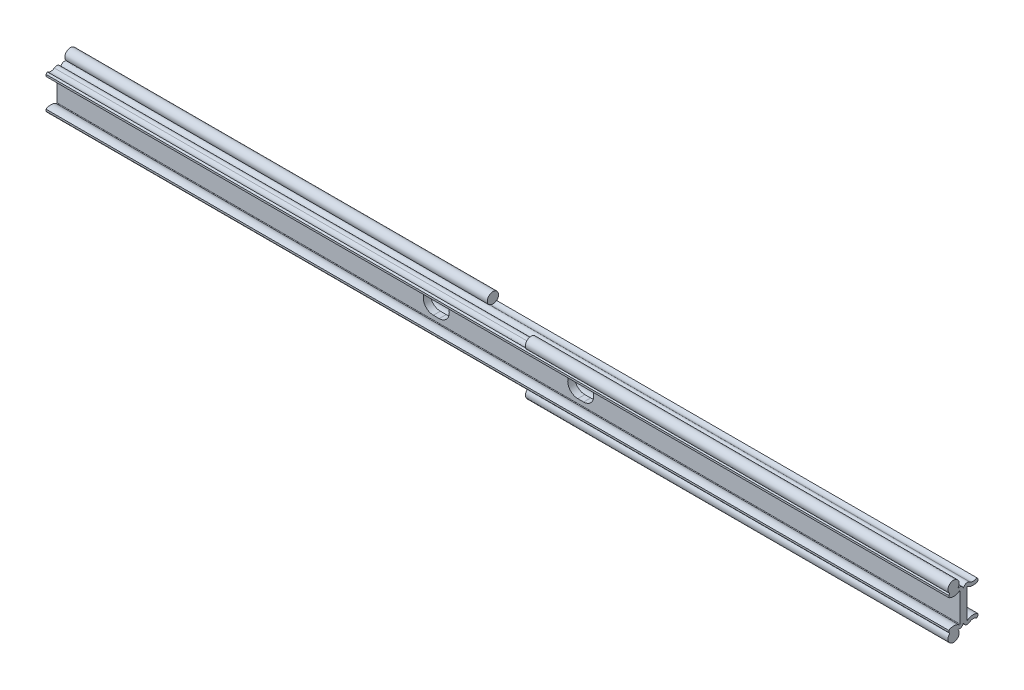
ISO-10303-21;
HEADER;
FILE_DESCRIPTION(('STEP AP214'),'2;1');
FILE_NAME('part.step','',(''),(''),'','','');
FILE_SCHEMA(('AUTOMOTIVE_DESIGN { 1 0 10303 214 1 1 1 1 }'));
ENDSEC;
DATA;
#1=APPLICATION_CONTEXT('core data for automotive mechanical design processes');
#2=APPLICATION_PROTOCOL_DEFINITION('international standard','automotive_design',2000,#1);
#3=PRODUCT_CONTEXT('',#1,'mechanical');
#4=PRODUCT('Part','Part','',(#3));
#5=PRODUCT_RELATED_PRODUCT_CATEGORY('part','',(#4));
#6=PRODUCT_DEFINITION_FORMATION('','',#4);
#7=PRODUCT_DEFINITION_CONTEXT('part definition',#1,'design');
#8=PRODUCT_DEFINITION('design','',#6,#7);
#9=PRODUCT_DEFINITION_SHAPE('','',#8);
#10=(LENGTH_UNIT() NAMED_UNIT(*) SI_UNIT(.MILLI.,.METRE.));
#11=(NAMED_UNIT(*) PLANE_ANGLE_UNIT() SI_UNIT($,.RADIAN.));
#12=(NAMED_UNIT(*) SI_UNIT($,.STERADIAN.) SOLID_ANGLE_UNIT());
#13=UNCERTAINTY_MEASURE_WITH_UNIT(LENGTH_MEASURE(1.E-05),#10,'distance_accuracy_value','');
#14=(GEOMETRIC_REPRESENTATION_CONTEXT(3) GLOBAL_UNCERTAINTY_ASSIGNED_CONTEXT((#13)) GLOBAL_UNIT_ASSIGNED_CONTEXT((#10,
#11,#12)) REPRESENTATION_CONTEXT('',''));
#15=CARTESIAN_POINT('',(0.,0.,0.));
#16=DIRECTION('',(0.,0.,1.));
#17=DIRECTION('',(1.,0.,0.));
#18=AXIS2_PLACEMENT_3D('',#15,#16,#17);
#19=CARTESIAN_POINT('',(-200.,9.67000022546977,4.31000011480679));
#20=DIRECTION('',(1.,0.,0.));
#21=DIRECTION('',(0.,0.,-1.));
#22=AXIS2_PLACEMENT_3D('',#19,#20,#21);
#23=CYLINDRICAL_SURFACE('',#22,2.48000011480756);
#24=CARTESIAN_POINT('',(12.8,9.67000022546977,4.31000011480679));
#25=DIRECTION('',(1.,0.,0.));
#26=DIRECTION('',(0.,0.,-1.));
#27=AXIS2_PLACEMENT_3D('',#24,#25,#26);
#28=CIRCLE('',#27,2.48000011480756);
#29=CARTESIAN_POINT('',(12.8,7.69573962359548,2.80910183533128));
#30=VERTEX_POINT('',#29);
#31=CARTESIAN_POINT('',(12.8,7.77020990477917,5.90411344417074));
#32=VERTEX_POINT('',#31);
#33=EDGE_CURVE('E323',#30,#32,#28,.F.);
#34=ORIENTED_EDGE('',*,*,#33,.F.);
#35=DIRECTION('',(1.,0.,0.));
#36=VECTOR('',#35,1.);
#37=CARTESIAN_POINT('',(-200.,7.69573962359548,2.80910183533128));
#38=LINE('',#37,#36);
#39=CARTESIAN_POINT('',(-200.,7.69573962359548,2.80910183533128));
#40=VERTEX_POINT('',#39);
#41=EDGE_CURVE('E545',#40,#30,#38,.T.);
#42=ORIENTED_EDGE('',*,*,#41,.F.);
#43=CARTESIAN_POINT('',(-200.,9.67000022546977,4.31000011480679));
#44=DIRECTION('',(1.,0.,0.));
#45=DIRECTION('',(0.,0.,-1.));
#46=AXIS2_PLACEMENT_3D('',#43,#44,#45);
#47=CIRCLE('',#46,2.48000011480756);
#48=CARTESIAN_POINT('',(-200.,7.77020990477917,5.90411344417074));
#49=VERTEX_POINT('',#48);
#50=EDGE_CURVE('E506',#49,#40,#47,.T.);
#51=ORIENTED_EDGE('',*,*,#50,.F.);
#52=DIRECTION('',(1.,0.,0.));
#53=VECTOR('',#52,1.);
#54=CARTESIAN_POINT('',(-200.,7.77020990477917,5.90411344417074));
#55=LINE('',#54,#53);
#56=EDGE_CURVE('E548',#49,#32,#55,.T.);
#57=ORIENTED_EDGE('',*,*,#56,.T.);
#58=EDGE_LOOP('',(#34,#42,#51,#57));
#59=FACE_BOUND('',#58,.T.);
#60=ADVANCED_FACE('F14',(#59),#23,.F.);
#61=CARTESIAN_POINT('',(-200.,9.67000022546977,-4.31000011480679));
#62=DIRECTION('',(1.,0.,0.));
#63=DIRECTION('',(0.,0.,-1.));
#64=AXIS2_PLACEMENT_3D('',#61,#62,#63);
#65=CYLINDRICAL_SURFACE('',#64,2.48000011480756);
#66=CARTESIAN_POINT('',(-12.8,9.67000022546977,-4.31000011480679));
#67=DIRECTION('',(-1.,0.,0.));
#68=DIRECTION('',(0.,0.,1.));
#69=AXIS2_PLACEMENT_3D('',#66,#67,#68);
#70=CIRCLE('',#69,2.48000011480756);
#71=CARTESIAN_POINT('',(-12.8,7.69573962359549,-2.80910183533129));
#72=VERTEX_POINT('',#71);
#73=CARTESIAN_POINT('',(-12.8,7.77020990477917,-5.90411344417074));
#74=VERTEX_POINT('',#73);
#75=EDGE_CURVE('E357',#72,#74,#70,.F.);
#76=ORIENTED_EDGE('',*,*,#75,.F.);
#77=DIRECTION('',(1.,0.,0.));
#78=VECTOR('',#77,1.);
#79=CARTESIAN_POINT('',(-200.,7.69573962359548,-2.80910183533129));
#80=LINE('',#79,#78);
#81=CARTESIAN_POINT('',(200.,7.69573962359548,-2.80910183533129));
#82=VERTEX_POINT('',#81);
#83=EDGE_CURVE('E540',#72,#82,#80,.T.);
#84=ORIENTED_EDGE('',*,*,#83,.T.);
#85=CARTESIAN_POINT('',(200.,9.67000022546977,-4.31000011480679));
#86=DIRECTION('',(1.,0.,0.));
#87=DIRECTION('',(0.,0.,1.));
#88=AXIS2_PLACEMENT_3D('',#85,#86,#87);
#89=CIRCLE('',#88,2.48000011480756);
#90=CARTESIAN_POINT('',(200.,7.77020990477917,-5.90411344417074));
#91=VERTEX_POINT('',#90);
#92=EDGE_CURVE('E459',#82,#91,#89,.T.);
#93=ORIENTED_EDGE('',*,*,#92,.T.);
#94=DIRECTION('',(1.,0.,0.));
#95=VECTOR('',#94,1.);
#96=CARTESIAN_POINT('',(-200.,7.77020990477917,-5.90411344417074));
#97=LINE('',#96,#95);
#98=EDGE_CURVE('E538',#74,#91,#97,.T.);
#99=ORIENTED_EDGE('',*,*,#98,.F.);
#100=EDGE_LOOP('',(#76,#84,#93,#99));
#101=FACE_BOUND('',#100,.T.);
#102=ADVANCED_FACE('F682',(#101),#65,.F.);
#103=CARTESIAN_POINT('',(-200.,-6.30261222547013,-1.75000011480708));
#104=DIRECTION('',(1.,0.,0.));
#105=DIRECTION('',(0.,0.,-1.));
#106=AXIS2_PLACEMENT_3D('',#103,#104,#105);
#107=CYLINDRICAL_SURFACE('',#106,0.200000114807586);
#108=CARTESIAN_POINT('',(200.,-6.30261222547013,-1.75000011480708));
#109=DIRECTION('',(1.,0.,0.));
#110=DIRECTION('',(0.,0.,-1.));
#111=AXIS2_PLACEMENT_3D('',#108,#109,#110);
#112=CIRCLE('',#111,0.200000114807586);
#113=CARTESIAN_POINT('',(200.,-6.30261222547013,-1.54999999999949));
#114=VERTEX_POINT('',#113);
#115=CARTESIAN_POINT('',(200.,-6.46182696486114,-1.87104024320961));
#116=VERTEX_POINT('',#115);
#117=EDGE_CURVE('E423',#114,#116,#112,.T.);
#118=ORIENTED_EDGE('',*,*,#117,.T.);
#119=DIRECTION('',(1.,0.,0.));
#120=VECTOR('',#119,1.);
#121=CARTESIAN_POINT('',(-200.,-6.46182696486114,-1.87104024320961));
#122=LINE('',#121,#120);
#123=CARTESIAN_POINT('',(-200.,-6.46182696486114,-1.87104024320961));
#124=VERTEX_POINT('',#123);
#125=EDGE_CURVE('E591',#124,#116,#122,.T.);
#126=ORIENTED_EDGE('',*,*,#125,.F.);
#127=CARTESIAN_POINT('',(-200.,-6.30261222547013,-1.75000011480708));
#128=DIRECTION('',(1.,0.,0.));
#129=DIRECTION('',(0.,0.,-1.));
#130=AXIS2_PLACEMENT_3D('',#127,#128,#129);
#131=CIRCLE('',#130,0.200000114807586);
#132=CARTESIAN_POINT('',(-200.,-6.30261222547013,-1.54999999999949));
#133=VERTEX_POINT('',#132);
#134=EDGE_CURVE('E472',#133,#124,#131,.T.);
#135=ORIENTED_EDGE('',*,*,#134,.F.);
#136=DIRECTION('',(1.,0.,0.));
#137=VECTOR('',#136,1.);
#138=CARTESIAN_POINT('',(-200.,-6.30261222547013,-1.54999999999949));
#139=LINE('',#138,#137);
#140=EDGE_CURVE('E523',#133,#114,#139,.T.);
#141=ORIENTED_EDGE('',*,*,#140,.T.);
#142=EDGE_LOOP('',(#118,#126,#135,#141));
#143=FACE_BOUND('',#142,.T.);
#144=ADVANCED_FACE('F16',(#143),#107,.F.);
#145=CARTESIAN_POINT('',(-200.,-9.67000022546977,-4.31000011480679));
#146=DIRECTION('',(1.,0.,0.));
#147=DIRECTION('',(0.,0.,-1.));
#148=AXIS2_PLACEMENT_3D('',#145,#146,#147);
#149=CYLINDRICAL_SURFACE('',#148,4.03000011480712);
#150=CARTESIAN_POINT('',(200.,-9.67000022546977,-4.31000011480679));
#151=DIRECTION('',(-1.,0.,0.));
#152=DIRECTION('',(0.,0.,-1.));
#153=AXIS2_PLACEMENT_3D('',#150,#151,#152);
#154=CIRCLE('',#153,4.03000011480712);
#155=CARTESIAN_POINT('',(200.,-6.26775086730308,-6.47000016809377));
#156=VERTEX_POINT('',#155);
#157=EDGE_CURVE('E426',#116,#156,#154,.T.);
#158=ORIENTED_EDGE('',*,*,#157,.T.);
#159=DIRECTION('',(1.,0.,0.));
#160=VECTOR('',#159,1.);
#161=CARTESIAN_POINT('',(-200.,-6.26775086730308,-6.47000016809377));
#162=LINE('',#161,#160);
#163=CARTESIAN_POINT('',(-200.,-6.26775086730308,-6.47000016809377));
#164=VERTEX_POINT('',#163);
#165=EDGE_CURVE('E588',#164,#156,#162,.T.);
#166=ORIENTED_EDGE('',*,*,#165,.F.);
#167=CARTESIAN_POINT('',(-200.,-9.67000022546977,-4.31000011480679));
#168=DIRECTION('',(-1.,0.,0.));
#169=DIRECTION('',(0.,0.,-1.));
#170=AXIS2_PLACEMENT_3D('',#167,#168,#169);
#171=CIRCLE('',#170,4.03000011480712);
#172=EDGE_CURVE('E475',#124,#164,#171,.T.);
#173=ORIENTED_EDGE('',*,*,#172,.F.);
#174=ORIENTED_EDGE('',*,*,#125,.T.);
#175=EDGE_LOOP('',(#158,#166,#173,#174));
#176=FACE_BOUND('',#175,.T.);
#177=ADVANCED_FACE('F731',(#176),#149,.T.);
#178=CARTESIAN_POINT('',(-200.,-6.26775086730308,-6.47000016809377));
#179=DIRECTION('',(0.,0.,1.));
#180=DIRECTION('',(1.,0.,0.));
#181=AXIS2_PLACEMENT_3D('',#178,#179,#180);
#182=PLANE('',#181);
#183=DIRECTION('',(0.,-1.,0.));
#184=VECTOR('',#183,1.);
#185=CARTESIAN_POINT('',(200.,-6.26775086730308,-6.47000016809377));
#186=LINE('',#185,#184);
#187=CARTESIAN_POINT('',(200.,-7.09581212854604,-6.47000016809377));
#188=VERTEX_POINT('',#187);
#189=EDGE_CURVE('E428',#156,#188,#186,.T.);
#190=ORIENTED_EDGE('',*,*,#189,.T.);
#191=DIRECTION('',(1.,0.,0.));
#192=VECTOR('',#191,1.);
#193=CARTESIAN_POINT('',(-200.,-7.09581212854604,-6.47000016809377));
#194=LINE('',#193,#192);
#195=CARTESIAN_POINT('',(-200.,-7.09581212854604,-6.47000016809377));
#196=VERTEX_POINT('',#195);
#197=EDGE_CURVE('E585',#196,#188,#194,.T.);
#198=ORIENTED_EDGE('',*,*,#197,.F.);
#199=DIRECTION('',(0.,-1.,0.));
#200=VECTOR('',#199,1.);
#201=CARTESIAN_POINT('',(-200.,-6.26775086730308,-6.47000016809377));
#202=LINE('',#201,#200);
#203=EDGE_CURVE('E477',#164,#196,#202,.T.);
#204=ORIENTED_EDGE('',*,*,#203,.F.);
#205=ORIENTED_EDGE('',*,*,#165,.T.);
#206=EDGE_LOOP('',(#190,#198,#204,#205));
#207=FACE_BOUND('',#206,.T.);
#208=ADVANCED_FACE('F728',(#207),#182,.F.);
#209=CARTESIAN_POINT('',(-200.,-7.77020990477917,-5.90411344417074));
#210=DIRECTION('',(0.,0.642787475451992,0.766044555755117));
#211=DIRECTION('',(0.,0.766044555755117,-0.642787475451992));
#212=AXIS2_PLACEMENT_3D('',#209,#210,#211);
#213=PLANE('',#212);
#214=DIRECTION('',(0.,0.766044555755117,-0.642787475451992));
#215=VECTOR('',#214,1.);
#216=CARTESIAN_POINT('',(-12.8,-7.77020990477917,-5.90411344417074));
#217=LINE('',#216,#215);
#218=CARTESIAN_POINT('',(-12.8,-7.77020990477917,-5.90411344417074));
#219=VERTEX_POINT('',#218);
#220=CARTESIAN_POINT('',(-12.8,-7.62948341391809,-6.02219694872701));
#221=VERTEX_POINT('',#220);
#222=EDGE_CURVE('E343',#219,#221,#217,.T.);
#223=ORIENTED_EDGE('',*,*,#222,.T.);
#224=DIRECTION('',(-1.,0.,0.));
#225=VECTOR('',#224,1.);
#226=CARTESIAN_POINT('',(-12.8,-7.62948341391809,-6.02219694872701));
#227=LINE('',#226,#225);
#228=CARTESIAN_POINT('',(-200.,-7.62948341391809,-6.02219694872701));
#229=VERTEX_POINT('',#228);
#230=EDGE_CURVE('E337',#221,#229,#227,.T.);
#231=ORIENTED_EDGE('',*,*,#230,.T.);
#232=DIRECTION('',(0.,-0.766044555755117,0.642787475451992));
#233=VECTOR('',#232,1.);
#234=CARTESIAN_POINT('',(-200.,-7.77020990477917,-5.90411344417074));
#235=LINE('',#234,#233);
#236=EDGE_CURVE('E479',#196,#229,#235,.T.);
#237=ORIENTED_EDGE('',*,*,#236,.F.);
#238=ORIENTED_EDGE('',*,*,#197,.T.);
#239=DIRECTION('',(0.,-0.766044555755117,0.642787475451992));
#240=VECTOR('',#239,1.);
#241=CARTESIAN_POINT('',(200.,-7.77020990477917,-5.90411344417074));
#242=LINE('',#241,#240);
#243=CARTESIAN_POINT('',(200.,-7.77020990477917,-5.90411344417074));
#244=VERTEX_POINT('',#243);
#245=EDGE_CURVE('E430',#188,#244,#242,.T.);
#246=ORIENTED_EDGE('',*,*,#245,.T.);
#247=DIRECTION('',(1.,0.,0.));
#248=VECTOR('',#247,1.);
#249=CARTESIAN_POINT('',(-200.,-7.77020990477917,-5.90411344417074));
#250=LINE('',#249,#248);
#251=EDGE_CURVE('E583',#219,#244,#250,.T.);
#252=ORIENTED_EDGE('',*,*,#251,.F.);
#253=EDGE_LOOP('',(#223,#231,#237,#238,#246,#252));
#254=FACE_BOUND('',#253,.T.);
#255=ADVANCED_FACE('F724',(#254),#213,.F.);
#256=CARTESIAN_POINT('',(-200.,-9.67000022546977,-4.31000011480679));
#257=DIRECTION('',(1.,0.,0.));
#258=DIRECTION('',(0.,0.,-1.));
#259=AXIS2_PLACEMENT_3D('',#256,#257,#258);
#260=CYLINDRICAL_SURFACE('',#259,2.48000011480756);
#261=DIRECTION('',(1.,0.,0.));
#262=VECTOR('',#261,1.);
#263=CARTESIAN_POINT('',(-200.,-7.69573962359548,-2.80910183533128));
#264=LINE('',#263,#262);
#265=CARTESIAN_POINT('',(-12.8,-7.69573962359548,-2.80910183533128));
#266=VERTEX_POINT('',#265);
#267=CARTESIAN_POINT('',(200.,-7.69573962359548,-2.80910183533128));
#268=VERTEX_POINT('',#267);
#269=EDGE_CURVE('E581',#266,#268,#264,.T.);
#270=ORIENTED_EDGE('',*,*,#269,.F.);
#271=CARTESIAN_POINT('',(-12.8,-9.67000022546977,-4.31000011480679));
#272=DIRECTION('',(1.,0.,0.));
#273=DIRECTION('',(0.,0.,-1.));
#274=AXIS2_PLACEMENT_3D('',#271,#272,#273);
#275=CIRCLE('',#274,2.48000011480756);
#276=EDGE_CURVE('E340',#266,#219,#275,.F.);
#277=ORIENTED_EDGE('',*,*,#276,.T.);
#278=ORIENTED_EDGE('',*,*,#251,.T.);
#279=CARTESIAN_POINT('',(200.,-9.67000022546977,-4.31000011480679));
#280=DIRECTION('',(1.,0.,0.));
#281=DIRECTION('',(0.,0.,-1.));
#282=AXIS2_PLACEMENT_3D('',#279,#280,#281);
#283=CIRCLE('',#282,2.48000011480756);
#284=EDGE_CURVE('E433',#244,#268,#283,.T.);
#285=ORIENTED_EDGE('',*,*,#284,.T.);
#286=EDGE_LOOP('',(#270,#277,#278,#285));
#287=FACE_BOUND('',#286,.T.);
#288=ADVANCED_FACE('F720',(#287),#260,.F.);
#289=CARTESIAN_POINT('',(-200.,-6.30261222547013,-1.75000011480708));
#290=DIRECTION('',(1.,0.,0.));
#291=DIRECTION('',(0.,0.,-1.));
#292=AXIS2_PLACEMENT_3D('',#289,#290,#291);
#293=CYLINDRICAL_SURFACE('',#292,1.75000011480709);
#294=CARTESIAN_POINT('',(-200.,-6.30261222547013,-1.75000011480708));
#295=DIRECTION('',(-1.,0.,0.));
#296=DIRECTION('',(0.,0.,-1.));
#297=AXIS2_PLACEMENT_3D('',#294,#295,#296);
#298=CIRCLE('',#297,1.75000011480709);
#299=CARTESIAN_POINT('',(-200.,-7.91637379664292,-2.42695948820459));
#300=VERTEX_POINT('',#299);
#301=CARTESIAN_POINT('',(-200.,-6.30261222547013,0.));
#302=VERTEX_POINT('',#301);
#303=EDGE_CURVE('E482',#300,#302,#298,.T.);
#304=ORIENTED_EDGE('',*,*,#303,.F.);
#305=DIRECTION('',(-1.,0.,0.));
#306=VECTOR('',#305,1.);
#307=CARTESIAN_POINT('',(-106.4,-7.91637379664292,-2.42695948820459));
#308=LINE('',#307,#306);
#309=CARTESIAN_POINT('',(-12.8,-7.91637379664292,-2.42695948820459));
#310=VERTEX_POINT('',#309);
#311=EDGE_CURVE('E333',#300,#310,#308,.F.);
#312=ORIENTED_EDGE('',*,*,#311,.T.);
#313=CARTESIAN_POINT('',(-12.8,-6.30261222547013,-1.75000011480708));
#314=DIRECTION('',(1.,0.,0.));
#315=DIRECTION('',(0.,0.,-1.));
#316=AXIS2_PLACEMENT_3D('',#313,#314,#315);
#317=CIRCLE('',#316,1.75000011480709);
#318=EDGE_CURVE('E596',#310,#266,#317,.T.);
#319=ORIENTED_EDGE('',*,*,#318,.T.);
#320=ORIENTED_EDGE('',*,*,#269,.T.);
#321=CARTESIAN_POINT('',(200.,-6.30261222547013,-1.75000011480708));
#322=DIRECTION('',(-1.,0.,0.));
#323=DIRECTION('',(0.,0.,-1.));
#324=AXIS2_PLACEMENT_3D('',#321,#322,#323);
#325=CIRCLE('',#324,1.75000011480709);
#326=CARTESIAN_POINT('',(200.,-6.30261222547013,0.));
#327=VERTEX_POINT('',#326);
#328=EDGE_CURVE('E436',#268,#327,#325,.T.);
#329=ORIENTED_EDGE('',*,*,#328,.T.);
#330=DIRECTION('',(1.,0.,0.));
#331=VECTOR('',#330,1.);
#332=CARTESIAN_POINT('',(-200.,-6.30261222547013,0.));
#333=LINE('',#332,#331);
#334=EDGE_CURVE('E578',#302,#327,#333,.T.);
#335=ORIENTED_EDGE('',*,*,#334,.F.);
#336=EDGE_LOOP('',(#304,#312,#319,#320,#329,#335));
#337=FACE_BOUND('',#336,.T.);
#338=ADVANCED_FACE('F717',(#337),#293,.T.);
#339=CARTESIAN_POINT('',(-200.,-6.30261222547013,1.75000011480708));
#340=DIRECTION('',(1.,0.,0.));
#341=DIRECTION('',(0.,0.,-1.));
#342=AXIS2_PLACEMENT_3D('',#339,#340,#341);
#343=CYLINDRICAL_SURFACE('',#342,1.75000011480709);
#344=CARTESIAN_POINT('',(200.,-6.30261222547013,1.75000011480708));
#345=DIRECTION('',(-1.,0.,0.));
#346=DIRECTION('',(0.,0.,1.));
#347=AXIS2_PLACEMENT_3D('',#344,#345,#346);
#348=CIRCLE('',#347,1.75000011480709);
#349=CARTESIAN_POINT('',(200.,-7.91637379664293,2.42695948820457));
#350=VERTEX_POINT('',#349);
#351=EDGE_CURVE('E292',#327,#350,#348,.T.);
#352=ORIENTED_EDGE('',*,*,#351,.T.);
#353=DIRECTION('',(1.,0.,0.));
#354=VECTOR('',#353,1.);
#355=CARTESIAN_POINT('',(106.4,-7.91637379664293,2.42695948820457));
#356=LINE('',#355,#354);
#357=CARTESIAN_POINT('',(12.8,-7.91637379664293,2.42695948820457));
#358=VERTEX_POINT('',#357);
#359=EDGE_CURVE('E29',#350,#358,#356,.F.);
#360=ORIENTED_EDGE('',*,*,#359,.T.);
#361=CARTESIAN_POINT('',(12.8,-6.30261222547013,1.75000011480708));
#362=DIRECTION('',(-1.,0.,0.));
#363=DIRECTION('',(0.,0.,1.));
#364=AXIS2_PLACEMENT_3D('',#361,#362,#363);
#365=CIRCLE('',#364,1.75000011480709);
#366=CARTESIAN_POINT('',(12.8,-7.69573962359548,2.80910183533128));
#367=VERTEX_POINT('',#366);
#368=EDGE_CURVE('E33',#358,#367,#365,.T.);
#369=ORIENTED_EDGE('',*,*,#368,.T.);
#370=DIRECTION('',(1.,0.,0.));
#371=VECTOR('',#370,1.);
#372=CARTESIAN_POINT('',(-200.,-7.69573962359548,2.80910183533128));
#373=LINE('',#372,#371);
#374=CARTESIAN_POINT('',(-200.,-7.69573962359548,2.80910183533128));
#375=VERTEX_POINT('',#374);
#376=EDGE_CURVE('E576',#375,#367,#373,.T.);
#377=ORIENTED_EDGE('',*,*,#376,.F.);
#378=CARTESIAN_POINT('',(-200.,-6.30261222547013,1.75000011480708));
#379=DIRECTION('',(-1.,0.,0.));
#380=DIRECTION('',(0.,0.,1.));
#381=AXIS2_PLACEMENT_3D('',#378,#379,#380);
#382=CIRCLE('',#381,1.75000011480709);
#383=EDGE_CURVE('E484',#302,#375,#382,.T.);
#384=ORIENTED_EDGE('',*,*,#383,.F.);
#385=ORIENTED_EDGE('',*,*,#334,.T.);
#386=EDGE_LOOP('',(#352,#360,#369,#377,#384,#385));
#387=FACE_BOUND('',#386,.T.);
#388=ADVANCED_FACE('F714',(#387),#343,.T.);
#389=CARTESIAN_POINT('',(-200.,-9.67000022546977,4.31000011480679));
#390=DIRECTION('',(1.,0.,0.));
#391=DIRECTION('',(0.,0.,-1.));
#392=AXIS2_PLACEMENT_3D('',#389,#390,#391);
#393=CYLINDRICAL_SURFACE('',#392,2.48000011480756);
#394=ORIENTED_EDGE('',*,*,#376,.T.);
#395=CARTESIAN_POINT('',(12.8,-9.67000022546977,4.31000011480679));
#396=DIRECTION('',(-1.,0.,0.));
#397=DIRECTION('',(0.,0.,1.));
#398=AXIS2_PLACEMENT_3D('',#395,#396,#397);
#399=CIRCLE('',#398,2.48000011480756);
#400=CARTESIAN_POINT('',(12.8,-7.77020990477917,5.90411344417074));
#401=VERTEX_POINT('',#400);
#402=EDGE_CURVE('E309',#367,#401,#399,.F.);
#403=ORIENTED_EDGE('',*,*,#402,.T.);
#404=DIRECTION('',(1.,0.,0.));
#405=VECTOR('',#404,1.);
#406=CARTESIAN_POINT('',(-200.,-7.77020990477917,5.90411344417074));
#407=LINE('',#406,#405);
#408=CARTESIAN_POINT('',(-200.,-7.77020990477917,5.90411344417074));
#409=VERTEX_POINT('',#408);
#410=EDGE_CURVE('E574',#409,#401,#407,.T.);
#411=ORIENTED_EDGE('',*,*,#410,.F.);
#412=CARTESIAN_POINT('',(-200.,-9.67000022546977,4.31000011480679));
#413=DIRECTION('',(1.,0.,0.));
#414=DIRECTION('',(0.,0.,1.));
#415=AXIS2_PLACEMENT_3D('',#412,#413,#414);
#416=CIRCLE('',#415,2.48000011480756);
#417=EDGE_CURVE('E486',#375,#409,#416,.T.);
#418=ORIENTED_EDGE('',*,*,#417,.F.);
#419=EDGE_LOOP('',(#394,#403,#411,#418));
#420=FACE_BOUND('',#419,.T.);
#421=ADVANCED_FACE('F667',(#420),#393,.F.);
#422=CARTESIAN_POINT('',(-200.,-7.77020990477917,5.90411344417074));
#423=DIRECTION('',(0.,0.642787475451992,-0.766044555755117));
#424=DIRECTION('',(0.,-0.766044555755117,-0.642787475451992));
#425=AXIS2_PLACEMENT_3D('',#422,#423,#424);
#426=PLANE('',#425);
#427=DIRECTION('',(0.,0.766044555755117,0.642787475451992));
#428=VECTOR('',#427,1.);
#429=CARTESIAN_POINT('',(12.8,-7.77020990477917,5.90411344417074));
#430=LINE('',#429,#428);
#431=CARTESIAN_POINT('',(12.8,-7.62948341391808,6.02219694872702));
#432=VERTEX_POINT('',#431);
#433=EDGE_CURVE('E9',#401,#432,#430,.T.);
#434=ORIENTED_EDGE('',*,*,#433,.T.);
#435=DIRECTION('',(1.,0.,0.));
#436=VECTOR('',#435,1.);
#437=CARTESIAN_POINT('',(12.8,-7.62948341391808,6.02219694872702));
#438=LINE('',#437,#436);
#439=CARTESIAN_POINT('',(200.,-7.62948341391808,6.02219694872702));
#440=VERTEX_POINT('',#439);
#441=EDGE_CURVE('E295',#432,#440,#438,.T.);
#442=ORIENTED_EDGE('',*,*,#441,.T.);
#443=DIRECTION('',(0.,0.766044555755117,0.642787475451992));
#444=VECTOR('',#443,1.);
#445=CARTESIAN_POINT('',(200.,-7.77020990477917,5.90411344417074));
#446=LINE('',#445,#444);
#447=CARTESIAN_POINT('',(200.,-7.09581212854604,6.47000016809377));
#448=VERTEX_POINT('',#447);
#449=EDGE_CURVE('E281',#440,#448,#446,.T.);
#450=ORIENTED_EDGE('',*,*,#449,.T.);
#451=DIRECTION('',(1.,0.,0.));
#452=VECTOR('',#451,1.);
#453=CARTESIAN_POINT('',(-200.,-7.09581212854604,6.47000016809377));
#454=LINE('',#453,#452);
#455=CARTESIAN_POINT('',(-200.,-7.09581212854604,6.47000016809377));
#456=VERTEX_POINT('',#455);
#457=EDGE_CURVE('E572',#456,#448,#454,.T.);
#458=ORIENTED_EDGE('',*,*,#457,.F.);
#459=DIRECTION('',(0.,0.766044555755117,0.642787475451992));
#460=VECTOR('',#459,1.);
#461=CARTESIAN_POINT('',(-200.,-7.77020990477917,5.90411344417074));
#462=LINE('',#461,#460);
#463=EDGE_CURVE('E488',#409,#456,#462,.T.);
#464=ORIENTED_EDGE('',*,*,#463,.F.);
#465=ORIENTED_EDGE('',*,*,#410,.T.);
#466=EDGE_LOOP('',(#434,#442,#450,#458,#464,#465));
#467=FACE_BOUND('',#466,.T.);
#468=ADVANCED_FACE('F296',(#467),#426,.F.);
#469=CARTESIAN_POINT('',(-200.,-6.26775086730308,6.47000016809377));
#470=DIRECTION('',(0.,0.,-1.));
#471=DIRECTION('',(-1.,0.,0.));
#472=AXIS2_PLACEMENT_3D('',#469,#470,#471);
#473=PLANE('',#472);
#474=DIRECTION('',(0.,1.,0.));
#475=VECTOR('',#474,1.);
#476=CARTESIAN_POINT('',(200.,-6.26775086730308,6.47000016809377));
#477=LINE('',#476,#475);
#478=CARTESIAN_POINT('',(200.,-6.26775086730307,6.47000016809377));
#479=VERTEX_POINT('',#478);
#480=EDGE_CURVE('E288',#448,#479,#477,.T.);
#481=ORIENTED_EDGE('',*,*,#480,.T.);
#482=DIRECTION('',(1.,0.,0.));
#483=VECTOR('',#482,1.);
#484=CARTESIAN_POINT('',(-200.,-6.26775086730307,6.47000016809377));
#485=LINE('',#484,#483);
#486=CARTESIAN_POINT('',(-200.,-6.26775086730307,6.47000016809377));
#487=VERTEX_POINT('',#486);
#488=EDGE_CURVE('E569',#487,#479,#485,.T.);
#489=ORIENTED_EDGE('',*,*,#488,.F.);
#490=DIRECTION('',(0.,1.,0.));
#491=VECTOR('',#490,1.);
#492=CARTESIAN_POINT('',(-200.,-6.26775086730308,6.47000016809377));
#493=LINE('',#492,#491);
#494=EDGE_CURVE('E490',#456,#487,#493,.T.);
#495=ORIENTED_EDGE('',*,*,#494,.F.);
#496=ORIENTED_EDGE('',*,*,#457,.T.);
#497=EDGE_LOOP('',(#481,#489,#495,#496));
#498=FACE_BOUND('',#497,.T.);
#499=ADVANCED_FACE('F661',(#498),#473,.F.);
#500=CARTESIAN_POINT('',(-200.,-9.67000022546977,4.31000011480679));
#501=DIRECTION('',(1.,0.,0.));
#502=DIRECTION('',(0.,0.,-1.));
#503=AXIS2_PLACEMENT_3D('',#500,#501,#502);
#504=CYLINDRICAL_SURFACE('',#503,4.03000011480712);
#505=CARTESIAN_POINT('',(200.,-9.67000022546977,4.31000011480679));
#506=DIRECTION('',(-1.,0.,0.));
#507=DIRECTION('',(0.,0.,1.));
#508=AXIS2_PLACEMENT_3D('',#505,#506,#507);
#509=CIRCLE('',#508,4.03000011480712);
#510=CARTESIAN_POINT('',(200.,-6.46182696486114,1.87104024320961));
#511=VERTEX_POINT('',#510);
#512=EDGE_CURVE('E440',#479,#511,#509,.T.);
#513=ORIENTED_EDGE('',*,*,#512,.T.);
#514=DIRECTION('',(1.,0.,0.));
#515=VECTOR('',#514,1.);
#516=CARTESIAN_POINT('',(-200.,-6.46182696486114,1.87104024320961));
#517=LINE('',#516,#515);
#518=CARTESIAN_POINT('',(-200.,-6.46182696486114,1.87104024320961));
#519=VERTEX_POINT('',#518);
#520=EDGE_CURVE('E566',#519,#511,#517,.T.);
#521=ORIENTED_EDGE('',*,*,#520,.F.);
#522=CARTESIAN_POINT('',(-200.,-9.67000022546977,4.31000011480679));
#523=DIRECTION('',(-1.,0.,0.));
#524=DIRECTION('',(0.,0.,1.));
#525=AXIS2_PLACEMENT_3D('',#522,#523,#524);
#526=CIRCLE('',#525,4.03000011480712);
#527=EDGE_CURVE('E492',#487,#519,#526,.T.);
#528=ORIENTED_EDGE('',*,*,#527,.F.);
#529=ORIENTED_EDGE('',*,*,#488,.T.);
#530=EDGE_LOOP('',(#513,#521,#528,#529));
#531=FACE_BOUND('',#530,.T.);
#532=ADVANCED_FACE('F657',(#531),#504,.T.);
#533=CARTESIAN_POINT('',(-200.,-6.30261222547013,1.75000011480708));
#534=DIRECTION('',(1.,0.,0.));
#535=DIRECTION('',(0.,0.,-1.));
#536=AXIS2_PLACEMENT_3D('',#533,#534,#535);
#537=CYLINDRICAL_SURFACE('',#536,0.200000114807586);
#538=CARTESIAN_POINT('',(200.,-6.30261222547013,1.75000011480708));
#539=DIRECTION('',(1.,0.,0.));
#540=DIRECTION('',(0.,0.,1.));
#541=AXIS2_PLACEMENT_3D('',#538,#539,#540);
#542=CIRCLE('',#541,0.200000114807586);
#543=CARTESIAN_POINT('',(200.,-6.30261222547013,1.54999999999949));
#544=VERTEX_POINT('',#543);
#545=EDGE_CURVE('E442',#511,#544,#542,.T.);
#546=ORIENTED_EDGE('',*,*,#545,.T.);
#547=DIRECTION('',(1.,0.,0.));
#548=VECTOR('',#547,1.);
#549=CARTESIAN_POINT('',(-200.,-6.30261222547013,1.54999999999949));
#550=LINE('',#549,#548);
#551=CARTESIAN_POINT('',(-200.,-6.30261222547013,1.54999999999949));
#552=VERTEX_POINT('',#551);
#553=EDGE_CURVE('E563',#552,#544,#550,.T.);
#554=ORIENTED_EDGE('',*,*,#553,.F.);
#555=CARTESIAN_POINT('',(-200.,-6.30261222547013,1.75000011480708));
#556=DIRECTION('',(1.,0.,0.));
#557=DIRECTION('',(0.,0.,1.));
#558=AXIS2_PLACEMENT_3D('',#555,#556,#557);
#559=CIRCLE('',#558,0.200000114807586);
#560=EDGE_CURVE('E494',#519,#552,#559,.T.);
#561=ORIENTED_EDGE('',*,*,#560,.F.);
#562=ORIENTED_EDGE('',*,*,#520,.T.);
#563=EDGE_LOOP('',(#546,#554,#561,#562));
#564=FACE_BOUND('',#563,.T.);
#565=ADVANCED_FACE('F652',(#564),#537,.F.);
#566=CARTESIAN_POINT('',(-200.,-6.30261222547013,1.54999999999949));
#567=DIRECTION('',(0.,0.,-1.));
#568=DIRECTION('',(-1.,0.,0.));
#569=AXIS2_PLACEMENT_3D('',#566,#567,#568);
#570=PLANE('',#569);
#571=DIRECTION('',(1.,0.,0.));
#572=VECTOR('',#571,1.);
#573=CARTESIAN_POINT('',(-33.3,-4.45,1.54999999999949));
#574=LINE('',#573,#572);
#575=CARTESIAN_POINT('',(-33.3,-4.45,1.54999999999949));
#576=VERTEX_POINT('',#575);
#577=CARTESIAN_POINT('',(-30.7,-4.45,1.54999999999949));
#578=VERTEX_POINT('',#577);
#579=EDGE_CURVE('E371',#576,#578,#574,.T.);
#580=ORIENTED_EDGE('',*,*,#579,.F.);
#581=CARTESIAN_POINT('',(-33.3,0.,1.54999999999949));
#582=DIRECTION('',(0.,0.,1.));
#583=DIRECTION('',(-1.,0.,0.));
#584=AXIS2_PLACEMENT_3D('',#581,#582,#583);
#585=CIRCLE('',#584,4.45);
#586=CARTESIAN_POINT('',(-33.3,4.45,1.54999999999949));
#587=VERTEX_POINT('',#586);
#588=EDGE_CURVE('E369',#587,#576,#585,.T.);
#589=ORIENTED_EDGE('',*,*,#588,.F.);
#590=DIRECTION('',(-1.,0.,0.));
#591=VECTOR('',#590,1.);
#592=CARTESIAN_POINT('',(-30.7,4.45,1.54999999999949));
#593=LINE('',#592,#591);
#594=CARTESIAN_POINT('',(-30.7,4.45,1.54999999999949));
#595=VERTEX_POINT('',#594);
#596=EDGE_CURVE('E377',#595,#587,#593,.T.);
#597=ORIENTED_EDGE('',*,*,#596,.F.);
#598=CARTESIAN_POINT('',(-30.7,0.,1.54999999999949));
#599=DIRECTION('',(0.,0.,1.));
#600=DIRECTION('',(-1.,0.,0.));
#601=AXIS2_PLACEMENT_3D('',#598,#599,#600);
#602=CIRCLE('',#601,4.45);
#603=EDGE_CURVE('E374',#578,#595,#602,.T.);
#604=ORIENTED_EDGE('',*,*,#603,.F.);
#605=EDGE_LOOP('',(#580,#589,#597,#604));
#606=FACE_BOUND('',#605,.T.);
#607=DIRECTION('',(1.,0.,0.));
#608=VECTOR('',#607,1.);
#609=CARTESIAN_POINT('',(33.3,-4.45,1.54999999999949));
#610=LINE('',#609,#608);
#611=CARTESIAN_POINT('',(30.7,-4.45,1.54999999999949));
#612=VERTEX_POINT('',#611);
#613=CARTESIAN_POINT('',(33.3,-4.45,1.54999999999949));
#614=VERTEX_POINT('',#613);
#615=EDGE_CURVE('E402',#612,#614,#610,.T.);
#616=ORIENTED_EDGE('',*,*,#615,.F.);
#617=CARTESIAN_POINT('',(30.7,0.,1.54999999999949));
#618=DIRECTION('',(0.,0.,1.));
#619=DIRECTION('',(1.,0.,0.));
#620=AXIS2_PLACEMENT_3D('',#617,#618,#619);
#621=CIRCLE('',#620,4.45);
#622=CARTESIAN_POINT('',(30.7,4.45,1.54999999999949));
#623=VERTEX_POINT('',#622);
#624=EDGE_CURVE('E400',#623,#612,#621,.T.);
#625=ORIENTED_EDGE('',*,*,#624,.F.);
#626=DIRECTION('',(-1.,0.,0.));
#627=VECTOR('',#626,1.);
#628=CARTESIAN_POINT('',(30.7,4.45,1.54999999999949));
#629=LINE('',#628,#627);
#630=CARTESIAN_POINT('',(33.3,4.45,1.54999999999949));
#631=VERTEX_POINT('',#630);
#632=EDGE_CURVE('E408',#631,#623,#629,.T.);
#633=ORIENTED_EDGE('',*,*,#632,.F.);
#634=CARTESIAN_POINT('',(33.3,0.,1.54999999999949));
#635=DIRECTION('',(0.,0.,1.));
#636=DIRECTION('',(1.,0.,0.));
#637=AXIS2_PLACEMENT_3D('',#634,#635,#636);
#638=CIRCLE('',#637,4.45);
#639=EDGE_CURVE('E405',#614,#631,#638,.T.);
#640=ORIENTED_EDGE('',*,*,#639,.F.);
#641=EDGE_LOOP('',(#616,#625,#633,#640));
#642=FACE_BOUND('',#641,.T.);
#643=DIRECTION('',(0.,1.,0.));
#644=VECTOR('',#643,1.);
#645=CARTESIAN_POINT('',(200.,-6.30261222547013,1.54999999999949));
#646=LINE('',#645,#644);
#647=CARTESIAN_POINT('',(200.,6.30261222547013,1.54999999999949));
#648=VERTEX_POINT('',#647);
#649=EDGE_CURVE('E444',#544,#648,#646,.T.);
#650=ORIENTED_EDGE('',*,*,#649,.T.);
#651=DIRECTION('',(1.,0.,0.));
#652=VECTOR('',#651,1.);
#653=CARTESIAN_POINT('',(-200.,6.30261222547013,1.54999999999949));
#654=LINE('',#653,#652);
#655=CARTESIAN_POINT('',(-200.,6.30261222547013,1.54999999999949));
#656=VERTEX_POINT('',#655);
#657=EDGE_CURVE('E560',#656,#648,#654,.T.);
#658=ORIENTED_EDGE('',*,*,#657,.F.);
#659=DIRECTION('',(0.,1.,0.));
#660=VECTOR('',#659,1.);
#661=CARTESIAN_POINT('',(-200.,-6.30261222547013,1.54999999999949));
#662=LINE('',#661,#660);
#663=EDGE_CURVE('E496',#552,#656,#662,.T.);
#664=ORIENTED_EDGE('',*,*,#663,.F.);
#665=ORIENTED_EDGE('',*,*,#553,.T.);
#666=EDGE_LOOP('',(#650,#658,#664,#665));
#667=FACE_BOUND('',#666,.T.);
#668=ADVANCED_FACE('F648',(#606,#642,#667),#570,.F.);
#669=CARTESIAN_POINT('',(-200.,6.30261222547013,1.75000011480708));
#670=DIRECTION('',(1.,0.,0.));
#671=DIRECTION('',(0.,0.,-1.));
#672=AXIS2_PLACEMENT_3D('',#669,#670,#671);
#673=CYLINDRICAL_SURFACE('',#672,0.200000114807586);
#674=CARTESIAN_POINT('',(200.,6.30261222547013,1.75000011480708));
#675=DIRECTION('',(1.,0.,0.));
#676=DIRECTION('',(0.,0.,-1.));
#677=AXIS2_PLACEMENT_3D('',#674,#675,#676);
#678=CIRCLE('',#677,0.200000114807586);
#679=CARTESIAN_POINT('',(200.,6.46182696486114,1.87104024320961));
#680=VERTEX_POINT('',#679);
#681=EDGE_CURVE('E446',#648,#680,#678,.T.);
#682=ORIENTED_EDGE('',*,*,#681,.T.);
#683=DIRECTION('',(1.,0.,0.));
#684=VECTOR('',#683,1.);
#685=CARTESIAN_POINT('',(-200.,6.46182696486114,1.87104024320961));
#686=LINE('',#685,#684);
#687=CARTESIAN_POINT('',(-200.,6.46182696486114,1.87104024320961));
#688=VERTEX_POINT('',#687);
#689=EDGE_CURVE('E557',#688,#680,#686,.T.);
#690=ORIENTED_EDGE('',*,*,#689,.F.);
#691=CARTESIAN_POINT('',(-200.,6.30261222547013,1.75000011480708));
#692=DIRECTION('',(1.,0.,0.));
#693=DIRECTION('',(0.,0.,-1.));
#694=AXIS2_PLACEMENT_3D('',#691,#692,#693);
#695=CIRCLE('',#694,0.200000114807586);
#696=EDGE_CURVE('E498',#656,#688,#695,.T.);
#697=ORIENTED_EDGE('',*,*,#696,.F.);
#698=ORIENTED_EDGE('',*,*,#657,.T.);
#699=EDGE_LOOP('',(#682,#690,#697,#698));
#700=FACE_BOUND('',#699,.T.);
#701=ADVANCED_FACE('F644',(#700),#673,.F.);
#702=CARTESIAN_POINT('',(-200.,9.67000022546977,4.31000011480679));
#703=DIRECTION('',(1.,0.,0.));
#704=DIRECTION('',(0.,0.,-1.));
#705=AXIS2_PLACEMENT_3D('',#702,#703,#704);
#706=CYLINDRICAL_SURFACE('',#705,4.03000011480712);
#707=CARTESIAN_POINT('',(200.,9.67000022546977,4.31000011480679));
#708=DIRECTION('',(-1.,0.,0.));
#709=DIRECTION('',(0.,0.,-1.));
#710=AXIS2_PLACEMENT_3D('',#707,#708,#709);
#711=CIRCLE('',#710,4.03000011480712);
#712=CARTESIAN_POINT('',(200.,6.26775086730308,6.47000016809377));
#713=VERTEX_POINT('',#712);
#714=EDGE_CURVE('E448',#680,#713,#711,.T.);
#715=ORIENTED_EDGE('',*,*,#714,.T.);
#716=DIRECTION('',(1.,0.,0.));
#717=VECTOR('',#716,1.);
#718=CARTESIAN_POINT('',(-200.,6.26775086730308,6.47000016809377));
#719=LINE('',#718,#717);
#720=CARTESIAN_POINT('',(-200.,6.26775086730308,6.47000016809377));
#721=VERTEX_POINT('',#720);
#722=EDGE_CURVE('E554',#721,#713,#719,.T.);
#723=ORIENTED_EDGE('',*,*,#722,.F.);
#724=CARTESIAN_POINT('',(-200.,9.67000022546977,4.31000011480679));
#725=DIRECTION('',(-1.,0.,0.));
#726=DIRECTION('',(0.,0.,-1.));
#727=AXIS2_PLACEMENT_3D('',#724,#725,#726);
#728=CIRCLE('',#727,4.03000011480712);
#729=EDGE_CURVE('E500',#688,#721,#728,.T.);
#730=ORIENTED_EDGE('',*,*,#729,.F.);
#731=ORIENTED_EDGE('',*,*,#689,.T.);
#732=EDGE_LOOP('',(#715,#723,#730,#731));
#733=FACE_BOUND('',#732,.T.);
#734=ADVANCED_FACE('F639',(#733),#706,.T.);
#735=CARTESIAN_POINT('',(-200.,6.26775086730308,6.47000016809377));
#736=DIRECTION('',(0.,0.,-1.));
#737=DIRECTION('',(-1.,0.,0.));
#738=AXIS2_PLACEMENT_3D('',#735,#736,#737);
#739=PLANE('',#738);
#740=DIRECTION('',(0.,1.,0.));
#741=VECTOR('',#740,1.);
#742=CARTESIAN_POINT('',(200.,6.26775086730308,6.47000016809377));
#743=LINE('',#742,#741);
#744=CARTESIAN_POINT('',(200.,7.09581212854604,6.47000016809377));
#745=VERTEX_POINT('',#744);
#746=EDGE_CURVE('E450',#713,#745,#743,.T.);
#747=ORIENTED_EDGE('',*,*,#746,.T.);
#748=DIRECTION('',(1.,0.,0.));
#749=VECTOR('',#748,1.);
#750=CARTESIAN_POINT('',(-200.,7.09581212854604,6.47000016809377));
#751=LINE('',#750,#749);
#752=CARTESIAN_POINT('',(-200.,7.09581212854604,6.47000016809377));
#753=VERTEX_POINT('',#752);
#754=EDGE_CURVE('E551',#753,#745,#751,.T.);
#755=ORIENTED_EDGE('',*,*,#754,.F.);
#756=DIRECTION('',(0.,1.,0.));
#757=VECTOR('',#756,1.);
#758=CARTESIAN_POINT('',(-200.,6.26775086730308,6.47000016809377));
#759=LINE('',#758,#757);
#760=EDGE_CURVE('E502',#721,#753,#759,.T.);
#761=ORIENTED_EDGE('',*,*,#760,.F.);
#762=ORIENTED_EDGE('',*,*,#722,.T.);
#763=EDGE_LOOP('',(#747,#755,#761,#762));
#764=FACE_BOUND('',#763,.T.);
#765=ADVANCED_FACE('F633',(#764),#739,.F.);
#766=CARTESIAN_POINT('',(-200.,7.77020990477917,5.90411344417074));
#767=DIRECTION('',(0.,-0.642787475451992,-0.766044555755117));
#768=DIRECTION('',(0.,-0.766044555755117,0.642787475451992));
#769=AXIS2_PLACEMENT_3D('',#766,#767,#768);
#770=PLANE('',#769);
#771=DIRECTION('',(0.,0.766044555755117,-0.642787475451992));
#772=VECTOR('',#771,1.);
#773=CARTESIAN_POINT('',(200.,7.77020990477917,5.90411344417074));
#774=LINE('',#773,#772);
#775=CARTESIAN_POINT('',(200.,7.62948341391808,6.02219694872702));
#776=VERTEX_POINT('',#775);
#777=EDGE_CURVE('E452',#745,#776,#774,.T.);
#778=ORIENTED_EDGE('',*,*,#777,.T.);
#779=DIRECTION('',(1.,0.,0.));
#780=VECTOR('',#779,1.);
#781=CARTESIAN_POINT('',(12.8,7.62948341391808,6.02219694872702));
#782=LINE('',#781,#780);
#783=CARTESIAN_POINT('',(12.8,7.62948341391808,6.02219694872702));
#784=VERTEX_POINT('',#783);
#785=EDGE_CURVE('E321',#776,#784,#782,.F.);
#786=ORIENTED_EDGE('',*,*,#785,.T.);
#787=DIRECTION('',(0.,-0.766044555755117,0.642787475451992));
#788=VECTOR('',#787,1.);
#789=CARTESIAN_POINT('',(12.8,7.77020990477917,5.90411344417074));
#790=LINE('',#789,#788);
#791=EDGE_CURVE('E326',#32,#784,#790,.T.);
#792=ORIENTED_EDGE('',*,*,#791,.F.);
#793=ORIENTED_EDGE('',*,*,#56,.F.);
#794=DIRECTION('',(0.,0.766044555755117,-0.642787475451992));
#795=VECTOR('',#794,1.);
#796=CARTESIAN_POINT('',(-200.,7.77020990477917,5.90411344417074));
#797=LINE('',#796,#795);
#798=EDGE_CURVE('E504',#753,#49,#797,.T.);
#799=ORIENTED_EDGE('',*,*,#798,.F.);
#800=ORIENTED_EDGE('',*,*,#754,.T.);
#801=EDGE_LOOP('',(#778,#786,#792,#793,#799,#800));
#802=FACE_BOUND('',#801,.T.);
#803=ADVANCED_FACE('F629',(#802),#770,.F.);
#804=CARTESIAN_POINT('',(-200.,6.30261222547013,1.75000011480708));
#805=DIRECTION('',(1.,0.,0.));
#806=DIRECTION('',(0.,0.,-1.));
#807=AXIS2_PLACEMENT_3D('',#804,#805,#806);
#808=CYLINDRICAL_SURFACE('',#807,1.75000011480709);
#809=CARTESIAN_POINT('',(12.8,6.30261222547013,1.75000011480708));
#810=DIRECTION('',(1.,0.,0.));
#811=DIRECTION('',(0.,0.,-1.));
#812=AXIS2_PLACEMENT_3D('',#809,#810,#811);
#813=CIRCLE('',#812,1.75000011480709);
#814=CARTESIAN_POINT('',(12.8,7.91637379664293,2.42695948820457));
#815=VERTEX_POINT('',#814);
#816=EDGE_CURVE('E22',#815,#30,#813,.T.);
#817=ORIENTED_EDGE('',*,*,#816,.F.);
#818=DIRECTION('',(1.,0.,0.));
#819=VECTOR('',#818,1.);
#820=CARTESIAN_POINT('',(106.4,7.91637379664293,2.42695948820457));
#821=LINE('',#820,#819);
#822=CARTESIAN_POINT('',(200.,7.91637379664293,2.42695948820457));
#823=VERTEX_POINT('',#822);
#824=EDGE_CURVE('E316',#815,#823,#821,.T.);
#825=ORIENTED_EDGE('',*,*,#824,.T.);
#826=CARTESIAN_POINT('',(200.,6.30261222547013,1.75000011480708));
#827=DIRECTION('',(-1.,0.,0.));
#828=DIRECTION('',(0.,0.,-1.));
#829=AXIS2_PLACEMENT_3D('',#826,#827,#828);
#830=CIRCLE('',#829,1.75000011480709);
#831=CARTESIAN_POINT('',(200.,6.30261222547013,0.));
#832=VERTEX_POINT('',#831);
#833=EDGE_CURVE('E454',#823,#832,#830,.T.);
#834=ORIENTED_EDGE('',*,*,#833,.T.);
#835=DIRECTION('',(1.,0.,0.));
#836=VECTOR('',#835,1.);
#837=CARTESIAN_POINT('',(-200.,6.30261222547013,0.));
#838=LINE('',#837,#836);
#839=CARTESIAN_POINT('',(-200.,6.30261222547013,0.));
#840=VERTEX_POINT('',#839);
#841=EDGE_CURVE('E542',#840,#832,#838,.T.);
#842=ORIENTED_EDGE('',*,*,#841,.F.);
#843=CARTESIAN_POINT('',(-200.,6.30261222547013,1.75000011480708));
#844=DIRECTION('',(-1.,0.,0.));
#845=DIRECTION('',(0.,0.,-1.));
#846=AXIS2_PLACEMENT_3D('',#843,#844,#845);
#847=CIRCLE('',#846,1.75000011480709);
#848=EDGE_CURVE('E508',#40,#840,#847,.T.);
#849=ORIENTED_EDGE('',*,*,#848,.F.);
#850=ORIENTED_EDGE('',*,*,#41,.T.);
#851=EDGE_LOOP('',(#817,#825,#834,#842,#849,#850));
#852=FACE_BOUND('',#851,.T.);
#853=ADVANCED_FACE('F604',(#852),#808,.T.);
#854=CARTESIAN_POINT('',(-200.,6.30261222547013,-1.75000011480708));
#855=DIRECTION('',(1.,0.,0.));
#856=DIRECTION('',(0.,0.,-1.));
#857=AXIS2_PLACEMENT_3D('',#854,#855,#856);
#858=CYLINDRICAL_SURFACE('',#857,1.75000011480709);
#859=CARTESIAN_POINT('',(-12.8,6.30261222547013,-1.75000011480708));
#860=DIRECTION('',(-1.,0.,0.));
#861=DIRECTION('',(0.,0.,1.));
#862=AXIS2_PLACEMENT_3D('',#859,#860,#861);
#863=CIRCLE('',#862,1.75000011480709);
#864=CARTESIAN_POINT('',(-12.8,7.91637379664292,-2.42695948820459));
#865=VERTEX_POINT('',#864);
#866=EDGE_CURVE('E359',#865,#72,#863,.T.);
#867=ORIENTED_EDGE('',*,*,#866,.F.);
#868=DIRECTION('',(-1.,0.,0.));
#869=VECTOR('',#868,1.);
#870=CARTESIAN_POINT('',(-106.4,7.91637379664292,-2.42695948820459));
#871=LINE('',#870,#869);
#872=CARTESIAN_POINT('',(-200.,7.91637379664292,-2.42695948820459));
#873=VERTEX_POINT('',#872);
#874=EDGE_CURVE('E354',#865,#873,#871,.T.);
#875=ORIENTED_EDGE('',*,*,#874,.T.);
#876=CARTESIAN_POINT('',(-200.,6.30261222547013,-1.75000011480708));
#877=DIRECTION('',(-1.,0.,0.));
#878=DIRECTION('',(0.,0.,1.));
#879=AXIS2_PLACEMENT_3D('',#876,#877,#878);
#880=CIRCLE('',#879,1.75000011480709);
#881=EDGE_CURVE('E510',#840,#873,#880,.T.);
#882=ORIENTED_EDGE('',*,*,#881,.F.);
#883=ORIENTED_EDGE('',*,*,#841,.T.);
#884=CARTESIAN_POINT('',(200.,6.30261222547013,-1.75000011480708));
#885=DIRECTION('',(-1.,0.,0.));
#886=DIRECTION('',(0.,0.,1.));
#887=AXIS2_PLACEMENT_3D('',#884,#885,#886);
#888=CIRCLE('',#887,1.75000011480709);
#889=EDGE_CURVE('E456',#832,#82,#888,.T.);
#890=ORIENTED_EDGE('',*,*,#889,.T.);
#891=ORIENTED_EDGE('',*,*,#83,.F.);
#892=EDGE_LOOP('',(#867,#875,#882,#883,#890,#891));
#893=FACE_BOUND('',#892,.T.);
#894=ADVANCED_FACE('F619',(#893),#858,.T.);
#895=CARTESIAN_POINT('',(-200.,7.77020990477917,-5.90411344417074));
#896=DIRECTION('',(0.,-0.642787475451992,0.766044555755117));
#897=DIRECTION('',(0.,0.766044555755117,0.642787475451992));
#898=AXIS2_PLACEMENT_3D('',#895,#896,#897);
#899=PLANE('',#898);
#900=DIRECTION('',(0.,-0.766044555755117,-0.642787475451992));
#901=VECTOR('',#900,1.);
#902=CARTESIAN_POINT('',(-200.,7.77020990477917,-5.90411344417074));
#903=LINE('',#902,#901);
#904=CARTESIAN_POINT('',(-200.,7.62948341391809,-6.02219694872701));
#905=VERTEX_POINT('',#904);
#906=CARTESIAN_POINT('',(-200.,7.09581212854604,-6.47000016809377));
#907=VERTEX_POINT('',#906);
#908=EDGE_CURVE('E513',#905,#907,#903,.T.);
#909=ORIENTED_EDGE('',*,*,#908,.F.);
#910=DIRECTION('',(-1.,0.,0.));
#911=VECTOR('',#910,1.);
#912=CARTESIAN_POINT('',(-12.8,7.62948341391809,-6.02219694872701));
#913=LINE('',#912,#911);
#914=CARTESIAN_POINT('',(-12.8,7.62948341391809,-6.02219694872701));
#915=VERTEX_POINT('',#914);
#916=EDGE_CURVE('E350',#905,#915,#913,.F.);
#917=ORIENTED_EDGE('',*,*,#916,.T.);
#918=DIRECTION('',(0.,-0.766044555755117,-0.642787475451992));
#919=VECTOR('',#918,1.);
#920=CARTESIAN_POINT('',(-12.8,7.77020990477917,-5.90411344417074));
#921=LINE('',#920,#919);
#922=EDGE_CURVE('E594',#74,#915,#921,.T.);
#923=ORIENTED_EDGE('',*,*,#922,.F.);
#924=ORIENTED_EDGE('',*,*,#98,.T.);
#925=DIRECTION('',(0.,-0.766044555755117,-0.642787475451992));
#926=VECTOR('',#925,1.);
#927=CARTESIAN_POINT('',(200.,7.77020990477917,-5.90411344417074));
#928=LINE('',#927,#926);
#929=CARTESIAN_POINT('',(200.,7.09581212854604,-6.47000016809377));
#930=VERTEX_POINT('',#929);
#931=EDGE_CURVE('E462',#91,#930,#928,.T.);
#932=ORIENTED_EDGE('',*,*,#931,.T.);
#933=DIRECTION('',(1.,0.,0.));
#934=VECTOR('',#933,1.);
#935=CARTESIAN_POINT('',(-200.,7.09581212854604,-6.47000016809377));
#936=LINE('',#935,#934);
#937=EDGE_CURVE('E535',#907,#930,#936,.T.);
#938=ORIENTED_EDGE('',*,*,#937,.F.);
#939=EDGE_LOOP('',(#909,#917,#923,#924,#932,#938));
#940=FACE_BOUND('',#939,.T.);
#941=ADVANCED_FACE('F777',(#940),#899,.F.);
#942=CARTESIAN_POINT('',(-200.,6.26775086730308,-6.47000016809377));
#943=DIRECTION('',(0.,0.,1.));
#944=DIRECTION('',(1.,0.,0.));
#945=AXIS2_PLACEMENT_3D('',#942,#943,#944);
#946=PLANE('',#945);
#947=DIRECTION('',(0.,-1.,0.));
#948=VECTOR('',#947,1.);
#949=CARTESIAN_POINT('',(200.,6.26775086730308,-6.47000016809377));
#950=LINE('',#949,#948);
#951=CARTESIAN_POINT('',(200.,6.26775086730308,-6.47000016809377));
#952=VERTEX_POINT('',#951);
#953=EDGE_CURVE('E464',#930,#952,#950,.T.);
#954=ORIENTED_EDGE('',*,*,#953,.T.);
#955=DIRECTION('',(1.,0.,0.));
#956=VECTOR('',#955,1.);
#957=CARTESIAN_POINT('',(-200.,6.26775086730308,-6.47000016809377));
#958=LINE('',#957,#956);
#959=CARTESIAN_POINT('',(-200.,6.26775086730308,-6.47000016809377));
#960=VERTEX_POINT('',#959);
#961=EDGE_CURVE('E532',#960,#952,#958,.T.);
#962=ORIENTED_EDGE('',*,*,#961,.F.);
#963=DIRECTION('',(0.,-1.,0.));
#964=VECTOR('',#963,1.);
#965=CARTESIAN_POINT('',(-200.,6.26775086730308,-6.47000016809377));
#966=LINE('',#965,#964);
#967=EDGE_CURVE('E515',#907,#960,#966,.T.);
#968=ORIENTED_EDGE('',*,*,#967,.F.);
#969=ORIENTED_EDGE('',*,*,#937,.T.);
#970=EDGE_LOOP('',(#954,#962,#968,#969));
#971=FACE_BOUND('',#970,.T.);
#972=ADVANCED_FACE('F772',(#971),#946,.F.);
#973=CARTESIAN_POINT('',(-200.,9.67000022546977,-4.31000011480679));
#974=DIRECTION('',(1.,0.,0.));
#975=DIRECTION('',(0.,0.,-1.));
#976=AXIS2_PLACEMENT_3D('',#973,#974,#975);
#977=CYLINDRICAL_SURFACE('',#976,4.03000011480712);
#978=CARTESIAN_POINT('',(200.,9.67000022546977,-4.31000011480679));
#979=DIRECTION('',(-1.,0.,0.));
#980=DIRECTION('',(0.,0.,1.));
#981=AXIS2_PLACEMENT_3D('',#978,#979,#980);
#982=CIRCLE('',#981,4.03000011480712);
#983=CARTESIAN_POINT('',(200.,6.46182696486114,-1.87104024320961));
#984=VERTEX_POINT('',#983);
#985=EDGE_CURVE('E466',#952,#984,#982,.T.);
#986=ORIENTED_EDGE('',*,*,#985,.T.);
#987=DIRECTION('',(1.,0.,0.));
#988=VECTOR('',#987,1.);
#989=CARTESIAN_POINT('',(-200.,6.46182696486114,-1.87104024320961));
#990=LINE('',#989,#988);
#991=CARTESIAN_POINT('',(-200.,6.46182696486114,-1.87104024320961));
#992=VERTEX_POINT('',#991);
#993=EDGE_CURVE('E529',#992,#984,#990,.T.);
#994=ORIENTED_EDGE('',*,*,#993,.F.);
#995=CARTESIAN_POINT('',(-200.,9.67000022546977,-4.31000011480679));
#996=DIRECTION('',(-1.,0.,0.));
#997=DIRECTION('',(0.,0.,1.));
#998=AXIS2_PLACEMENT_3D('',#995,#996,#997);
#999=CIRCLE('',#998,4.03000011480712);
#1000=EDGE_CURVE('E517',#960,#992,#999,.T.);
#1001=ORIENTED_EDGE('',*,*,#1000,.F.);
#1002=ORIENTED_EDGE('',*,*,#961,.T.);
#1003=EDGE_LOOP('',(#986,#994,#1001,#1002));
#1004=FACE_BOUND('',#1003,.T.);
#1005=ADVANCED_FACE('F767',(#1004),#977,.T.);
#1006=CARTESIAN_POINT('',(-200.,6.30261222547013,-1.75000011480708));
#1007=DIRECTION('',(1.,0.,0.));
#1008=DIRECTION('',(0.,0.,-1.));
#1009=AXIS2_PLACEMENT_3D('',#1006,#1007,#1008);
#1010=CYLINDRICAL_SURFACE('',#1009,0.200000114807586);
#1011=CARTESIAN_POINT('',(200.,6.30261222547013,-1.75000011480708));
#1012=DIRECTION('',(1.,0.,0.));
#1013=DIRECTION('',(0.,0.,1.));
#1014=AXIS2_PLACEMENT_3D('',#1011,#1012,#1013);
#1015=CIRCLE('',#1014,0.200000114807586);
#1016=CARTESIAN_POINT('',(200.,6.30261222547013,-1.54999999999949));
#1017=VERTEX_POINT('',#1016);
#1018=EDGE_CURVE('E468',#984,#1017,#1015,.T.);
#1019=ORIENTED_EDGE('',*,*,#1018,.T.);
#1020=DIRECTION('',(1.,0.,0.));
#1021=VECTOR('',#1020,1.);
#1022=CARTESIAN_POINT('',(-200.,6.30261222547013,-1.54999999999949));
#1023=LINE('',#1022,#1021);
#1024=CARTESIAN_POINT('',(-200.,6.30261222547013,-1.54999999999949));
#1025=VERTEX_POINT('',#1024);
#1026=EDGE_CURVE('E526',#1025,#1017,#1023,.T.);
#1027=ORIENTED_EDGE('',*,*,#1026,.F.);
#1028=CARTESIAN_POINT('',(-200.,6.30261222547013,-1.75000011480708));
#1029=DIRECTION('',(1.,0.,0.));
#1030=DIRECTION('',(0.,0.,1.));
#1031=AXIS2_PLACEMENT_3D('',#1028,#1029,#1030);
#1032=CIRCLE('',#1031,0.200000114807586);
#1033=EDGE_CURVE('E519',#992,#1025,#1032,.T.);
#1034=ORIENTED_EDGE('',*,*,#1033,.F.);
#1035=ORIENTED_EDGE('',*,*,#993,.T.);
#1036=EDGE_LOOP('',(#1019,#1027,#1034,#1035));
#1037=FACE_BOUND('',#1036,.T.);
#1038=ADVANCED_FACE('F763',(#1037),#1010,.F.);
#1039=CARTESIAN_POINT('',(-200.,-6.30261222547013,-1.54999999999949));
#1040=DIRECTION('',(0.,0.,1.));
#1041=DIRECTION('',(1.,0.,0.));
#1042=AXIS2_PLACEMENT_3D('',#1039,#1040,#1041);
#1043=PLANE('',#1042);
#1044=DIRECTION('',(1.,0.,0.));
#1045=VECTOR('',#1044,1.);
#1046=CARTESIAN_POINT('',(-30.7,4.45,-1.54999999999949));
#1047=LINE('',#1046,#1045);
#1048=CARTESIAN_POINT('',(-33.3,4.45,-1.54999999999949));
#1049=VERTEX_POINT('',#1048);
#1050=CARTESIAN_POINT('',(-30.7,4.45,-1.54999999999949));
#1051=VERTEX_POINT('',#1050);
#1052=EDGE_CURVE('E363',#1049,#1051,#1047,.T.);
#1053=ORIENTED_EDGE('',*,*,#1052,.F.);
#1054=CARTESIAN_POINT('',(-33.3,0.,-1.54999999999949));
#1055=DIRECTION('',(0.,0.,1.));
#1056=DIRECTION('',(1.,0.,0.));
#1057=AXIS2_PLACEMENT_3D('',#1054,#1055,#1056);
#1058=CIRCLE('',#1057,4.45);
#1059=CARTESIAN_POINT('',(-33.3,-4.45,-1.54999999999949));
#1060=VERTEX_POINT('',#1059);
#1061=EDGE_CURVE('E366',#1060,#1049,#1058,.F.);
#1062=ORIENTED_EDGE('',*,*,#1061,.F.);
#1063=DIRECTION('',(-1.,0.,0.));
#1064=VECTOR('',#1063,1.);
#1065=CARTESIAN_POINT('',(-33.3,-4.45,-1.54999999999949));
#1066=LINE('',#1065,#1064);
#1067=CARTESIAN_POINT('',(-30.7,-4.45,-1.54999999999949));
#1068=VERTEX_POINT('',#1067);
#1069=EDGE_CURVE('E383',#1068,#1060,#1066,.T.);
#1070=ORIENTED_EDGE('',*,*,#1069,.F.);
#1071=CARTESIAN_POINT('',(-30.7,0.,-1.54999999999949));
#1072=DIRECTION('',(0.,0.,1.));
#1073=DIRECTION('',(1.,0.,0.));
#1074=AXIS2_PLACEMENT_3D('',#1071,#1072,#1073);
#1075=CIRCLE('',#1074,4.45);
#1076=EDGE_CURVE('E361',#1051,#1068,#1075,.F.);
#1077=ORIENTED_EDGE('',*,*,#1076,.F.);
#1078=EDGE_LOOP('',(#1053,#1062,#1070,#1077));
#1079=FACE_BOUND('',#1078,.T.);
#1080=DIRECTION('',(1.,0.,0.));
#1081=VECTOR('',#1080,1.);
#1082=CARTESIAN_POINT('',(30.7,4.45,-1.54999999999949));
#1083=LINE('',#1082,#1081);
#1084=CARTESIAN_POINT('',(30.7,4.45,-1.54999999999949));
#1085=VERTEX_POINT('',#1084);
#1086=CARTESIAN_POINT('',(33.3,4.45,-1.54999999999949));
#1087=VERTEX_POINT('',#1086);
#1088=EDGE_CURVE('E394',#1085,#1087,#1083,.T.);
#1089=ORIENTED_EDGE('',*,*,#1088,.F.);
#1090=CARTESIAN_POINT('',(30.7,0.,-1.54999999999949));
#1091=DIRECTION('',(0.,0.,1.));
#1092=DIRECTION('',(1.,0.,0.));
#1093=AXIS2_PLACEMENT_3D('',#1090,#1091,#1092);
#1094=CIRCLE('',#1093,4.45);
#1095=CARTESIAN_POINT('',(30.7,-4.45,-1.54999999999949));
#1096=VERTEX_POINT('',#1095);
#1097=EDGE_CURVE('E397',#1096,#1085,#1094,.F.);
#1098=ORIENTED_EDGE('',*,*,#1097,.F.);
#1099=DIRECTION('',(-1.,0.,0.));
#1100=VECTOR('',#1099,1.);
#1101=CARTESIAN_POINT('',(33.3,-4.45,-1.54999999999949));
#1102=LINE('',#1101,#1100);
#1103=CARTESIAN_POINT('',(33.3,-4.45,-1.54999999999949));
#1104=VERTEX_POINT('',#1103);
#1105=EDGE_CURVE('E414',#1104,#1096,#1102,.T.);
#1106=ORIENTED_EDGE('',*,*,#1105,.F.);
#1107=CARTESIAN_POINT('',(33.3,0.,-1.54999999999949));
#1108=DIRECTION('',(0.,0.,1.));
#1109=DIRECTION('',(1.,0.,0.));
#1110=AXIS2_PLACEMENT_3D('',#1107,#1108,#1109);
#1111=CIRCLE('',#1110,4.45);
#1112=EDGE_CURVE('E392',#1087,#1104,#1111,.F.);
#1113=ORIENTED_EDGE('',*,*,#1112,.F.);
#1114=EDGE_LOOP('',(#1089,#1098,#1106,#1113));
#1115=FACE_BOUND('',#1114,.T.);
#1116=DIRECTION('',(0.,-1.,0.));
#1117=VECTOR('',#1116,1.);
#1118=CARTESIAN_POINT('',(200.,-6.30261222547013,-1.54999999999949));
#1119=LINE('',#1118,#1117);
#1120=EDGE_CURVE('E470',#1017,#114,#1119,.T.);
#1121=ORIENTED_EDGE('',*,*,#1120,.T.);
#1122=ORIENTED_EDGE('',*,*,#140,.F.);
#1123=DIRECTION('',(0.,-1.,0.));
#1124=VECTOR('',#1123,1.);
#1125=CARTESIAN_POINT('',(-200.,-6.30261222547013,-1.54999999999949));
#1126=LINE('',#1125,#1124);
#1127=EDGE_CURVE('E521',#1025,#133,#1126,.T.);
#1128=ORIENTED_EDGE('',*,*,#1127,.F.);
#1129=ORIENTED_EDGE('',*,*,#1026,.T.);
#1130=EDGE_LOOP('',(#1121,#1122,#1128,#1129));
#1131=FACE_BOUND('',#1130,.T.);
#1132=ADVANCED_FACE('F759',(#1079,#1115,#1131),#1043,.F.);
#1133=CARTESIAN_POINT('',(-200.,-6.30261222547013,-1.75000011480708));
#1134=DIRECTION('',(1.,0.,0.));
#1135=DIRECTION('',(0.,0.,-1.));
#1136=AXIS2_PLACEMENT_3D('',#1133,#1134,#1135);
#1137=PLANE('',#1136);
#1138=ORIENTED_EDGE('',*,*,#236,.T.);
#1139=CARTESIAN_POINT('',(-200.,-9.47,-4.36));
#1140=DIRECTION('',(-1.,0.,0.));
#1141=DIRECTION('',(0.,0.,-1.));
#1142=AXIS2_PLACEMENT_3D('',#1139,#1140,#1141);
#1143=CIRCLE('',#1142,2.48);
#1144=EDGE_CURVE('E329',#229,#300,#1143,.T.);
#1145=ORIENTED_EDGE('',*,*,#1144,.T.);
#1146=ORIENTED_EDGE('',*,*,#303,.T.);
#1147=ORIENTED_EDGE('',*,*,#383,.T.);
#1148=ORIENTED_EDGE('',*,*,#417,.T.);
#1149=ORIENTED_EDGE('',*,*,#463,.T.);
#1150=ORIENTED_EDGE('',*,*,#494,.T.);
#1151=ORIENTED_EDGE('',*,*,#527,.T.);
#1152=ORIENTED_EDGE('',*,*,#560,.T.);
#1153=ORIENTED_EDGE('',*,*,#663,.T.);
#1154=ORIENTED_EDGE('',*,*,#696,.T.);
#1155=ORIENTED_EDGE('',*,*,#729,.T.);
#1156=ORIENTED_EDGE('',*,*,#760,.T.);
#1157=ORIENTED_EDGE('',*,*,#798,.T.);
#1158=ORIENTED_EDGE('',*,*,#50,.T.);
#1159=ORIENTED_EDGE('',*,*,#848,.T.);
#1160=ORIENTED_EDGE('',*,*,#881,.T.);
#1161=CARTESIAN_POINT('',(-200.,9.47,-4.36));
#1162=DIRECTION('',(-1.,0.,0.));
#1163=DIRECTION('',(0.,0.,1.));
#1164=AXIS2_PLACEMENT_3D('',#1161,#1162,#1163);
#1165=CIRCLE('',#1164,2.48);
#1166=EDGE_CURVE('E346',#873,#905,#1165,.T.);
#1167=ORIENTED_EDGE('',*,*,#1166,.T.);
#1168=ORIENTED_EDGE('',*,*,#908,.T.);
#1169=ORIENTED_EDGE('',*,*,#967,.T.);
#1170=ORIENTED_EDGE('',*,*,#1000,.T.);
#1171=ORIENTED_EDGE('',*,*,#1033,.T.);
#1172=ORIENTED_EDGE('',*,*,#1127,.T.);
#1173=ORIENTED_EDGE('',*,*,#134,.T.);
#1174=ORIENTED_EDGE('',*,*,#172,.T.);
#1175=ORIENTED_EDGE('',*,*,#203,.T.);
#1176=EDGE_LOOP('',(#1138,#1145,#1146,#1147,#1148,#1149,#1150,#1151,#1152,#1153,#1154,#1155,
#1156,#1157,#1158,#1159,#1160,#1167,#1168,#1169,#1170,#1171,#1172,#1173,#1174,#1175));
#1177=FACE_BOUND('',#1176,.T.);
#1178=ADVANCED_FACE('F622',(#1177),#1137,.F.);
#1179=CARTESIAN_POINT('',(200.,-6.30261222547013,-1.75000011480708));
#1180=DIRECTION('',(1.,0.,0.));
#1181=DIRECTION('',(0.,0.,-1.));
#1182=AXIS2_PLACEMENT_3D('',#1179,#1180,#1181);
#1183=PLANE('',#1182);
#1184=ORIENTED_EDGE('',*,*,#449,.F.);
#1185=CARTESIAN_POINT('',(200.,-9.47,4.36));
#1186=DIRECTION('',(1.,0.,0.));
#1187=DIRECTION('',(0.,0.,1.));
#1188=AXIS2_PLACEMENT_3D('',#1185,#1186,#1187);
#1189=CIRCLE('',#1188,2.48);
#1190=EDGE_CURVE('E286',#440,#350,#1189,.T.);
#1191=ORIENTED_EDGE('',*,*,#1190,.T.);
#1192=ORIENTED_EDGE('',*,*,#351,.F.);
#1193=ORIENTED_EDGE('',*,*,#328,.F.);
#1194=ORIENTED_EDGE('',*,*,#284,.F.);
#1195=ORIENTED_EDGE('',*,*,#245,.F.);
#1196=ORIENTED_EDGE('',*,*,#189,.F.);
#1197=ORIENTED_EDGE('',*,*,#157,.F.);
#1198=ORIENTED_EDGE('',*,*,#117,.F.);
#1199=ORIENTED_EDGE('',*,*,#1120,.F.);
#1200=ORIENTED_EDGE('',*,*,#1018,.F.);
#1201=ORIENTED_EDGE('',*,*,#985,.F.);
#1202=ORIENTED_EDGE('',*,*,#953,.F.);
#1203=ORIENTED_EDGE('',*,*,#931,.F.);
#1204=ORIENTED_EDGE('',*,*,#92,.F.);
#1205=ORIENTED_EDGE('',*,*,#889,.F.);
#1206=ORIENTED_EDGE('',*,*,#833,.F.);
#1207=CARTESIAN_POINT('',(200.,9.47,4.36));
#1208=DIRECTION('',(1.,0.,0.));
#1209=DIRECTION('',(0.,0.,-1.));
#1210=AXIS2_PLACEMENT_3D('',#1207,#1208,#1209);
#1211=CIRCLE('',#1210,2.48);
#1212=EDGE_CURVE('E312',#823,#776,#1211,.T.);
#1213=ORIENTED_EDGE('',*,*,#1212,.T.);
#1214=ORIENTED_EDGE('',*,*,#777,.F.);
#1215=ORIENTED_EDGE('',*,*,#746,.F.);
#1216=ORIENTED_EDGE('',*,*,#714,.F.);
#1217=ORIENTED_EDGE('',*,*,#681,.F.);
#1218=ORIENTED_EDGE('',*,*,#649,.F.);
#1219=ORIENTED_EDGE('',*,*,#545,.F.);
#1220=ORIENTED_EDGE('',*,*,#512,.F.);
#1221=ORIENTED_EDGE('',*,*,#480,.F.);
#1222=EDGE_LOOP('',(#1184,#1191,#1192,#1193,#1194,#1195,#1196,#1197,#1198,#1199,#1200,#1201,
#1202,#1203,#1204,#1205,#1206,#1213,#1214,#1215,#1216,#1217,#1218,#1219,#1220,#1221));
#1223=FACE_BOUND('',#1222,.T.);
#1224=ADVANCED_FACE('F283',(#1223),#1183,.T.);
#1225=CARTESIAN_POINT('',(30.7,0.,-6.47100016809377));
#1226=DIRECTION('',(0.,0.,1.));
#1227=DIRECTION('',(1.,0.,0.));
#1228=AXIS2_PLACEMENT_3D('',#1225,#1226,#1227);
#1229=CYLINDRICAL_SURFACE('',#1228,4.45);
#1230=ORIENTED_EDGE('',*,*,#1097,.T.);
#1231=DIRECTION('',(0.,0.,1.));
#1232=VECTOR('',#1231,1.);
#1233=CARTESIAN_POINT('',(30.7,4.45,-6.47100016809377));
#1234=LINE('',#1233,#1232);
#1235=EDGE_CURVE('E412',#1085,#623,#1234,.T.);
#1236=ORIENTED_EDGE('',*,*,#1235,.T.);
#1237=ORIENTED_EDGE('',*,*,#624,.T.);
#1238=DIRECTION('',(0.,0.,1.));
#1239=VECTOR('',#1238,1.);
#1240=CARTESIAN_POINT('',(30.7,-4.45,-6.47100016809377));
#1241=LINE('',#1240,#1239);
#1242=EDGE_CURVE('E411',#1096,#612,#1241,.T.);
#1243=ORIENTED_EDGE('',*,*,#1242,.F.);
#1244=EDGE_LOOP('',(#1230,#1236,#1237,#1243));
#1245=FACE_BOUND('',#1244,.T.);
#1246=ADVANCED_FACE('F820',(#1245),#1229,.F.);
#1247=CARTESIAN_POINT('',(30.7,4.45,-6.47100016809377));
#1248=DIRECTION('',(0.,1.,0.));
#1249=DIRECTION('',(-1.,0.,0.));
#1250=AXIS2_PLACEMENT_3D('',#1247,#1248,#1249);
#1251=PLANE('',#1250);
#1252=ORIENTED_EDGE('',*,*,#1088,.T.);
#1253=DIRECTION('',(0.,0.,1.));
#1254=VECTOR('',#1253,1.);
#1255=CARTESIAN_POINT('',(33.3,4.45,-6.47100016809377));
#1256=LINE('',#1255,#1254);
#1257=EDGE_CURVE('E415',#1087,#631,#1256,.T.);
#1258=ORIENTED_EDGE('',*,*,#1257,.T.);
#1259=ORIENTED_EDGE('',*,*,#632,.T.);
#1260=ORIENTED_EDGE('',*,*,#1235,.F.);
#1261=EDGE_LOOP('',(#1252,#1258,#1259,#1260));
#1262=FACE_BOUND('',#1261,.T.);
#1263=ADVANCED_FACE('F816',(#1262),#1251,.F.);
#1264=CARTESIAN_POINT('',(33.3,0.,-6.47100016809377));
#1265=DIRECTION('',(0.,0.,1.));
#1266=DIRECTION('',(1.,0.,0.));
#1267=AXIS2_PLACEMENT_3D('',#1264,#1265,#1266);
#1268=CYLINDRICAL_SURFACE('',#1267,4.45);
#1269=ORIENTED_EDGE('',*,*,#1112,.T.);
#1270=DIRECTION('',(0.,0.,1.));
#1271=VECTOR('',#1270,1.);
#1272=CARTESIAN_POINT('',(33.3,-4.45,-6.47100016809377));
#1273=LINE('',#1272,#1271);
#1274=EDGE_CURVE('E417',#1104,#614,#1273,.T.);
#1275=ORIENTED_EDGE('',*,*,#1274,.T.);
#1276=ORIENTED_EDGE('',*,*,#639,.T.);
#1277=ORIENTED_EDGE('',*,*,#1257,.F.);
#1278=EDGE_LOOP('',(#1269,#1275,#1276,#1277));
#1279=FACE_BOUND('',#1278,.T.);
#1280=ADVANCED_FACE('F819',(#1279),#1268,.F.);
#1281=CARTESIAN_POINT('',(33.3,-4.45,-6.47100016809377));
#1282=DIRECTION('',(0.,-1.,0.));
#1283=DIRECTION('',(1.,0.,0.));
#1284=AXIS2_PLACEMENT_3D('',#1281,#1282,#1283);
#1285=PLANE('',#1284);
#1286=ORIENTED_EDGE('',*,*,#1105,.T.);
#1287=ORIENTED_EDGE('',*,*,#1242,.T.);
#1288=ORIENTED_EDGE('',*,*,#615,.T.);
#1289=ORIENTED_EDGE('',*,*,#1274,.F.);
#1290=EDGE_LOOP('',(#1286,#1287,#1288,#1289));
#1291=FACE_BOUND('',#1290,.T.);
#1292=ADVANCED_FACE('F814',(#1291),#1285,.F.);
#1293=CARTESIAN_POINT('',(-33.3,0.,-6.47100016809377));
#1294=DIRECTION('',(0.,0.,1.));
#1295=DIRECTION('',(1.,0.,0.));
#1296=AXIS2_PLACEMENT_3D('',#1293,#1294,#1295);
#1297=CYLINDRICAL_SURFACE('',#1296,4.45);
#1298=ORIENTED_EDGE('',*,*,#1061,.T.);
#1299=DIRECTION('',(0.,0.,1.));
#1300=VECTOR('',#1299,1.);
#1301=CARTESIAN_POINT('',(-33.3,4.45,-6.47100016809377));
#1302=LINE('',#1301,#1300);
#1303=EDGE_CURVE('E381',#1049,#587,#1302,.T.);
#1304=ORIENTED_EDGE('',*,*,#1303,.T.);
#1305=ORIENTED_EDGE('',*,*,#588,.T.);
#1306=DIRECTION('',(0.,0.,1.));
#1307=VECTOR('',#1306,1.);
#1308=CARTESIAN_POINT('',(-33.3,-4.45,-6.47100016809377));
#1309=LINE('',#1308,#1307);
#1310=EDGE_CURVE('E380',#1060,#576,#1309,.T.);
#1311=ORIENTED_EDGE('',*,*,#1310,.F.);
#1312=EDGE_LOOP('',(#1298,#1304,#1305,#1311));
#1313=FACE_BOUND('',#1312,.T.);
#1314=ADVANCED_FACE('F804',(#1313),#1297,.F.);
#1315=CARTESIAN_POINT('',(-30.7,4.45,-6.47100016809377));
#1316=DIRECTION('',(0.,1.,0.));
#1317=DIRECTION('',(-1.,0.,0.));
#1318=AXIS2_PLACEMENT_3D('',#1315,#1316,#1317);
#1319=PLANE('',#1318);
#1320=ORIENTED_EDGE('',*,*,#1052,.T.);
#1321=DIRECTION('',(0.,0.,1.));
#1322=VECTOR('',#1321,1.);
#1323=CARTESIAN_POINT('',(-30.7,4.45,-6.47100016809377));
#1324=LINE('',#1323,#1322);
#1325=EDGE_CURVE('E384',#1051,#595,#1324,.T.);
#1326=ORIENTED_EDGE('',*,*,#1325,.T.);
#1327=ORIENTED_EDGE('',*,*,#596,.T.);
#1328=ORIENTED_EDGE('',*,*,#1303,.F.);
#1329=EDGE_LOOP('',(#1320,#1326,#1327,#1328));
#1330=FACE_BOUND('',#1329,.T.);
#1331=ADVANCED_FACE('F800',(#1330),#1319,.F.);
#1332=CARTESIAN_POINT('',(-30.7,0.,-6.47100016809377));
#1333=DIRECTION('',(0.,0.,1.));
#1334=DIRECTION('',(1.,0.,0.));
#1335=AXIS2_PLACEMENT_3D('',#1332,#1333,#1334);
#1336=CYLINDRICAL_SURFACE('',#1335,4.45);
#1337=ORIENTED_EDGE('',*,*,#1076,.T.);
#1338=DIRECTION('',(0.,0.,1.));
#1339=VECTOR('',#1338,1.);
#1340=CARTESIAN_POINT('',(-30.7,-4.45,-6.47100016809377));
#1341=LINE('',#1340,#1339);
#1342=EDGE_CURVE('E386',#1068,#578,#1341,.T.);
#1343=ORIENTED_EDGE('',*,*,#1342,.T.);
#1344=ORIENTED_EDGE('',*,*,#603,.T.);
#1345=ORIENTED_EDGE('',*,*,#1325,.F.);
#1346=EDGE_LOOP('',(#1337,#1343,#1344,#1345));
#1347=FACE_BOUND('',#1346,.T.);
#1348=ADVANCED_FACE('F803',(#1347),#1336,.F.);
#1349=CARTESIAN_POINT('',(-33.3,-4.45,-6.47100016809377));
#1350=DIRECTION('',(0.,-1.,0.));
#1351=DIRECTION('',(1.,0.,0.));
#1352=AXIS2_PLACEMENT_3D('',#1349,#1350,#1351);
#1353=PLANE('',#1352);
#1354=ORIENTED_EDGE('',*,*,#1069,.T.);
#1355=ORIENTED_EDGE('',*,*,#1310,.T.);
#1356=ORIENTED_EDGE('',*,*,#579,.T.);
#1357=ORIENTED_EDGE('',*,*,#1342,.F.);
#1358=EDGE_LOOP('',(#1354,#1355,#1356,#1357));
#1359=FACE_BOUND('',#1358,.T.);
#1360=ADVANCED_FACE('F797',(#1359),#1353,.F.);
#1361=CARTESIAN_POINT('',(-12.8,9.47,-4.36));
#1362=DIRECTION('',(-1.,0.,0.));
#1363=DIRECTION('',(0.,0.,1.));
#1364=AXIS2_PLACEMENT_3D('',#1361,#1362,#1363);
#1365=PLANE('',#1364);
#1366=CARTESIAN_POINT('',(-12.8,9.47,-4.36));
#1367=DIRECTION('',(-1.,0.,0.));
#1368=DIRECTION('',(0.,0.,1.));
#1369=AXIS2_PLACEMENT_3D('',#1366,#1367,#1368);
#1370=CIRCLE('',#1369,2.48);
#1371=EDGE_CURVE('E347',#865,#915,#1370,.T.);
#1372=ORIENTED_EDGE('',*,*,#1371,.F.);
#1373=ORIENTED_EDGE('',*,*,#866,.T.);
#1374=ORIENTED_EDGE('',*,*,#75,.T.);
#1375=ORIENTED_EDGE('',*,*,#922,.T.);
#1376=EDGE_LOOP('',(#1372,#1373,#1374,#1375));
#1377=FACE_BOUND('',#1376,.T.);
#1378=ADVANCED_FACE('F783',(#1377),#1365,.F.);
#1379=CARTESIAN_POINT('',(-12.8,9.47,-4.36));
#1380=DIRECTION('',(-1.,0.,0.));
#1381=DIRECTION('',(0.,0.,1.));
#1382=AXIS2_PLACEMENT_3D('',#1379,#1380,#1381);
#1383=CYLINDRICAL_SURFACE('',#1382,2.48);
#1384=ORIENTED_EDGE('',*,*,#874,.F.);
#1385=ORIENTED_EDGE('',*,*,#1371,.T.);
#1386=ORIENTED_EDGE('',*,*,#916,.F.);
#1387=ORIENTED_EDGE('',*,*,#1166,.F.);
#1388=EDGE_LOOP('',(#1384,#1385,#1386,#1387));
#1389=FACE_BOUND('',#1388,.T.);
#1390=ADVANCED_FACE('F785',(#1389),#1383,.T.);
#1391=CARTESIAN_POINT('',(-12.8,-9.47,-4.36));
#1392=DIRECTION('',(-1.,0.,0.));
#1393=DIRECTION('',(0.,0.,1.));
#1394=AXIS2_PLACEMENT_3D('',#1391,#1392,#1393);
#1395=CYLINDRICAL_SURFACE('',#1394,2.48);
#1396=ORIENTED_EDGE('',*,*,#230,.F.);
#1397=CARTESIAN_POINT('',(-12.8,-9.47,-4.36));
#1398=DIRECTION('',(-1.,0.,0.));
#1399=DIRECTION('',(0.,0.,-1.));
#1400=AXIS2_PLACEMENT_3D('',#1397,#1398,#1399);
#1401=CIRCLE('',#1400,2.48);
#1402=EDGE_CURVE('E330',#221,#310,#1401,.T.);
#1403=ORIENTED_EDGE('',*,*,#1402,.T.);
#1404=ORIENTED_EDGE('',*,*,#311,.F.);
#1405=ORIENTED_EDGE('',*,*,#1144,.F.);
#1406=EDGE_LOOP('',(#1396,#1403,#1404,#1405));
#1407=FACE_BOUND('',#1406,.T.);
#1408=ADVANCED_FACE('F787',(#1407),#1395,.T.);
#1409=CARTESIAN_POINT('',(-12.8,-9.47,-4.36));
#1410=DIRECTION('',(1.,0.,0.));
#1411=DIRECTION('',(0.,0.,-1.));
#1412=AXIS2_PLACEMENT_3D('',#1409,#1410,#1411);
#1413=PLANE('',#1412);
#1414=ORIENTED_EDGE('',*,*,#222,.F.);
#1415=ORIENTED_EDGE('',*,*,#276,.F.);
#1416=ORIENTED_EDGE('',*,*,#318,.F.);
#1417=ORIENTED_EDGE('',*,*,#1402,.F.);
#1418=EDGE_LOOP('',(#1414,#1415,#1416,#1417));
#1419=FACE_BOUND('',#1418,.T.);
#1420=ADVANCED_FACE('F794',(#1419),#1413,.T.);
#1421=CARTESIAN_POINT('',(12.8,9.47,4.36));
#1422=DIRECTION('',(1.,0.,0.));
#1423=DIRECTION('',(0.,0.,-1.));
#1424=AXIS2_PLACEMENT_3D('',#1421,#1422,#1423);
#1425=CYLINDRICAL_SURFACE('',#1424,2.48);
#1426=ORIENTED_EDGE('',*,*,#785,.F.);
#1427=ORIENTED_EDGE('',*,*,#1212,.F.);
#1428=ORIENTED_EDGE('',*,*,#824,.F.);
#1429=CARTESIAN_POINT('',(12.8,9.47,4.36));
#1430=DIRECTION('',(1.,0.,0.));
#1431=DIRECTION('',(0.,0.,-1.));
#1432=AXIS2_PLACEMENT_3D('',#1429,#1430,#1431);
#1433=CIRCLE('',#1432,2.48);
#1434=EDGE_CURVE('E313',#815,#784,#1433,.T.);
#1435=ORIENTED_EDGE('',*,*,#1434,.T.);
#1436=EDGE_LOOP('',(#1426,#1427,#1428,#1435));
#1437=FACE_BOUND('',#1436,.T.);
#1438=ADVANCED_FACE('F610',(#1437),#1425,.T.);
#1439=CARTESIAN_POINT('',(12.8,9.47,4.36));
#1440=DIRECTION('',(1.,0.,0.));
#1441=DIRECTION('',(0.,0.,-1.));
#1442=AXIS2_PLACEMENT_3D('',#1439,#1440,#1441);
#1443=PLANE('',#1442);
#1444=ORIENTED_EDGE('',*,*,#33,.T.);
#1445=ORIENTED_EDGE('',*,*,#791,.T.);
#1446=ORIENTED_EDGE('',*,*,#1434,.F.);
#1447=ORIENTED_EDGE('',*,*,#816,.T.);
#1448=EDGE_LOOP('',(#1444,#1445,#1446,#1447));
#1449=FACE_BOUND('',#1448,.T.);
#1450=ADVANCED_FACE('F601',(#1449),#1443,.F.);
#1451=CARTESIAN_POINT('',(12.8,-9.47,4.36));
#1452=DIRECTION('',(-1.,0.,0.));
#1453=DIRECTION('',(0.,0.,1.));
#1454=AXIS2_PLACEMENT_3D('',#1451,#1452,#1453);
#1455=PLANE('',#1454);
#1456=ORIENTED_EDGE('',*,*,#368,.F.);
#1457=CARTESIAN_POINT('',(12.8,-9.47,4.36));
#1458=DIRECTION('',(1.,0.,0.));
#1459=DIRECTION('',(0.,0.,1.));
#1460=AXIS2_PLACEMENT_3D('',#1457,#1458,#1459);
#1461=CIRCLE('',#1460,2.48);
#1462=EDGE_CURVE('E302',#432,#358,#1461,.T.);
#1463=ORIENTED_EDGE('',*,*,#1462,.F.);
#1464=ORIENTED_EDGE('',*,*,#433,.F.);
#1465=ORIENTED_EDGE('',*,*,#402,.F.);
#1466=EDGE_LOOP('',(#1456,#1463,#1464,#1465));
#1467=FACE_BOUND('',#1466,.T.);
#1468=ADVANCED_FACE('F670',(#1467),#1455,.T.);
#1469=CARTESIAN_POINT('',(12.8,-9.47,4.36));
#1470=DIRECTION('',(1.,0.,0.));
#1471=DIRECTION('',(0.,0.,-1.));
#1472=AXIS2_PLACEMENT_3D('',#1469,#1470,#1471);
#1473=CYLINDRICAL_SURFACE('',#1472,2.48);
#1474=ORIENTED_EDGE('',*,*,#359,.F.);
#1475=ORIENTED_EDGE('',*,*,#1190,.F.);
#1476=ORIENTED_EDGE('',*,*,#441,.F.);
#1477=ORIENTED_EDGE('',*,*,#1462,.T.);
#1478=EDGE_LOOP('',(#1474,#1475,#1476,#1477));
#1479=FACE_BOUND('',#1478,.T.);
#1480=ADVANCED_FACE('F304',(#1479),#1473,.T.);
#1481=CLOSED_SHELL('',(#60,#102,#144,#177,#208,#255,#288,#338,#388,#421,#468,#499,#532,#565,
#668,#701,#734,#765,#803,#853,#894,#941,#972,#1005,#1038,#1132,#1178,#1224,#1246,#1263,#1280,
#1292,#1314,#1331,#1348,#1360,#1378,#1390,#1408,#1420,#1438,#1450,#1468,#1480));
#1482=MANIFOLD_SOLID_BREP('B1',#1481);
#1483=ADVANCED_BREP_SHAPE_REPRESENTATION('',(#18,#1482),#14);
#1484=SHAPE_DEFINITION_REPRESENTATION(#9,#1483);
ENDSEC;
END-ISO-10303-21;
